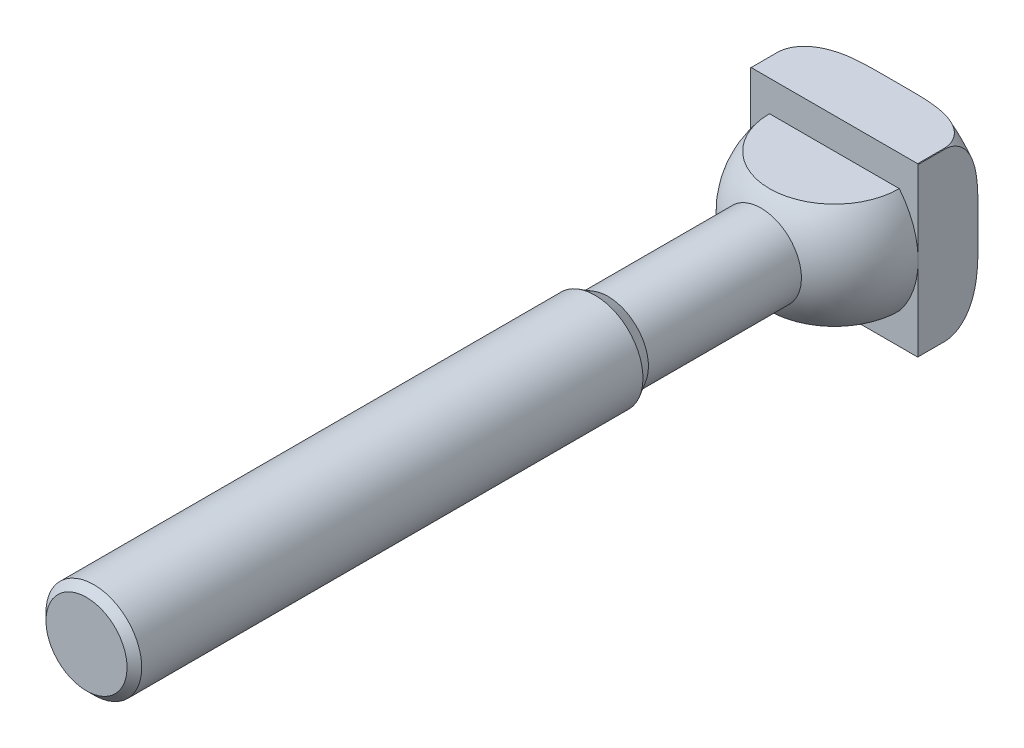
ISO-10303-21;
HEADER;
FILE_DESCRIPTION(('STEP AP214'),'2;1');
FILE_NAME('part.step','',(''),(''),'','','');
FILE_SCHEMA(('AUTOMOTIVE_DESIGN { 1 0 10303 214 1 1 1 1 }'));
ENDSEC;
DATA;
#1=APPLICATION_CONTEXT('core data for automotive mechanical design processes');
#2=APPLICATION_PROTOCOL_DEFINITION('international standard','automotive_design',2000,#1);
#3=PRODUCT_CONTEXT('',#1,'mechanical');
#4=PRODUCT('Part','Part','',(#3));
#5=PRODUCT_RELATED_PRODUCT_CATEGORY('part','',(#4));
#6=PRODUCT_DEFINITION_FORMATION('','',#4);
#7=PRODUCT_DEFINITION_CONTEXT('part definition',#1,'design');
#8=PRODUCT_DEFINITION('design','',#6,#7);
#9=PRODUCT_DEFINITION_SHAPE('','',#8);
#10=(LENGTH_UNIT() NAMED_UNIT(*) SI_UNIT(.MILLI.,.METRE.));
#11=(NAMED_UNIT(*) PLANE_ANGLE_UNIT() SI_UNIT($,.RADIAN.));
#12=(NAMED_UNIT(*) SI_UNIT($,.STERADIAN.) SOLID_ANGLE_UNIT());
#13=UNCERTAINTY_MEASURE_WITH_UNIT(LENGTH_MEASURE(1.E-05),#10,'distance_accuracy_value','');
#14=(GEOMETRIC_REPRESENTATION_CONTEXT(3) GLOBAL_UNCERTAINTY_ASSIGNED_CONTEXT((#13)) GLOBAL_UNIT_ASSIGNED_CONTEXT((#10,
#11,#12)) REPRESENTATION_CONTEXT('',''));
#15=CARTESIAN_POINT('',(0.,0.,0.));
#16=DIRECTION('',(0.,0.,1.));
#17=DIRECTION('',(1.,0.,0.));
#18=AXIS2_PLACEMENT_3D('',#15,#16,#17);
#19=CARTESIAN_POINT('',(0.,0.,-4.4));
#20=DIRECTION('',(0.,0.,1.));
#21=DIRECTION('',(0.,1.,0.));
#22=AXIS2_PLACEMENT_3D('',#19,#20,#21);
#23=TOROIDAL_SURFACE('',#22,14.14,5.6);
#24=CARTESIAN_POINT('',(-14.,0.,-9.99824972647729));
#25=CARTESIAN_POINT('',(-14.,-0.310759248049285,-9.99825085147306));
#26=CARTESIAN_POINT('',(-14.,-0.621518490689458,-9.99853784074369));
#27=CARTESIAN_POINT('',(-14.,-1.24303661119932,-9.99934060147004));
#28=CARTESIAN_POINT('',(-14.,-1.55379548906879,-9.99985637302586));
#29=CARTESIAN_POINT('',(-14.,-2.17555675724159,-10.0000957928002));
#30=CARTESIAN_POINT('',(-14.,-2.48655914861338,-9.99981882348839));
#31=CARTESIAN_POINT('',(-14.,-3.10856376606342,-9.99683999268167));
#32=CARTESIAN_POINT('',(-14.,-3.41956599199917,-9.99413807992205));
#33=CARTESIAN_POINT('',(-14.,-4.04142447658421,-9.98415314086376));
#34=CARTESIAN_POINT('',(-14.,-4.35228075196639,-9.97687135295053));
#35=CARTESIAN_POINT('',(-14.,-4.97375164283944,-9.95513103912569));
#36=CARTESIAN_POINT('',(-14.,-5.28436626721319,-9.94067279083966));
#37=CARTESIAN_POINT('',(-14.,-5.9045731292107,-9.90163480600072));
#38=CARTESIAN_POINT('',(-14.,-6.21416618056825,-9.87706873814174));
#39=CARTESIAN_POINT('',(-14.,-6.83210242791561,-9.8145243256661));
#40=CARTESIAN_POINT('',(-14.,-7.14044538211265,-9.77654350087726));
#41=CARTESIAN_POINT('',(-14.,-7.76037724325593,-9.68271738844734));
#42=CARTESIAN_POINT('',(-14.,-8.07191904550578,-9.62655135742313));
#43=CARTESIAN_POINT('',(-14.,-8.69023154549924,-9.49254678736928));
#44=CARTESIAN_POINT('',(-14.,-8.99700487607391,-9.41472069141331));
#45=CARTESIAN_POINT('',(-14.,-9.60149117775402,-9.23352582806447));
#46=CARTESIAN_POINT('',(-14.,-9.89923995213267,-9.13027881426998));
#47=CARTESIAN_POINT('',(-14.,-10.4824504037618,-8.89388231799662));
#48=CARTESIAN_POINT('',(-14.,-10.7679262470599,-8.76076847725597));
#49=CARTESIAN_POINT('',(-14.,-11.3136573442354,-8.46441782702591));
#50=CARTESIAN_POINT('',(-14.,-11.5743689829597,-8.30203188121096));
#51=CARTESIAN_POINT('',(-14.,-12.0709995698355,-7.94177662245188));
#52=CARTESIAN_POINT('',(-14.,-12.3068984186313,-7.74387888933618));
#53=CARTESIAN_POINT('',(-14.,-12.63518165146,-7.41887852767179));
#54=CARTESIAN_POINT('',(-14.,-12.7408989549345,-7.30509090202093));
#55=CARTESIAN_POINT('',(-14.,-12.9416863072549,-7.06851889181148));
#56=CARTESIAN_POINT('',(-14.,-13.0367621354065,-6.94573945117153));
#57=CARTESIAN_POINT('',(-14.,-13.2145748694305,-6.69177024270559));
#58=CARTESIAN_POINT('',(-14.,-13.2973291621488,-6.56059270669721));
#59=CARTESIAN_POINT('',(-14.,-13.4490161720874,-6.2905462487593));
#60=CARTESIAN_POINT('',(-14.,-13.5179540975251,-6.15168025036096));
#61=CARTESIAN_POINT('',(-14.,-13.6697783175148,-5.79932831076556));
#62=CARTESIAN_POINT('',(-14.,-13.7436357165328,-5.58184122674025));
#63=CARTESIAN_POINT('',(-14.,-13.8537149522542,-5.13762264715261));
#64=CARTESIAN_POINT('',(-14.,-13.8899558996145,-4.91089590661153));
#65=CARTESIAN_POINT('',(-14.,-13.9227119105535,-4.45413617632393));
#66=CARTESIAN_POINT('',(-14.,-13.9191559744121,-4.22409800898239));
#67=CARTESIAN_POINT('',(-14.,-13.8723552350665,-3.76811077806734));
#68=CARTESIAN_POINT('',(-14.,-13.8291052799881,-3.54216224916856));
#69=CARTESIAN_POINT('',(-14.,-13.7070151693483,-3.10597064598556));
#70=CARTESIAN_POINT('',(-14.,-13.6290387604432,-2.89548280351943));
#71=CARTESIAN_POINT('',(-14.,-13.4418093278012,-2.48903531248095));
#72=CARTESIAN_POINT('',(-14.,-13.3325526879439,-2.29307734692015));
#73=CARTESIAN_POINT('',(-14.,-13.0760306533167,-1.90105488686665));
#74=CARTESIAN_POINT('',(-14.,-12.9261604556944,-1.70670634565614));
#75=CARTESIAN_POINT('',(-14.,-12.6009114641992,-1.34062905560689));
#76=CARTESIAN_POINT('',(-14.,-12.425510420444,-1.16892028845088));
#77=CARTESIAN_POINT('',(-14.,-12.0933369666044,-0.881603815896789));
#78=CARTESIAN_POINT('',(-14.,-11.9401944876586,-0.761732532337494));
#79=CARTESIAN_POINT('',(-14.,-11.6238593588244,-0.535952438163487));
#80=CARTESIAN_POINT('',(-14.,-11.4606616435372,-0.430050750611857));
#81=CARTESIAN_POINT('',(-14.,-11.1262197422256,-0.231514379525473));
#82=CARTESIAN_POINT('',(-14.,-10.9549677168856,-0.138892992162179));
#83=CARTESIAN_POINT('',(-14.,-10.6063402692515,0.0338060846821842));
#84=CARTESIAN_POINT('',(-14.,-10.428965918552,0.113885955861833));
#85=CARTESIAN_POINT('',(-14.,-9.95291874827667,0.310667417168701));
#86=CARTESIAN_POINT('',(-14.,-9.65013791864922,0.41746585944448));
#87=CARTESIAN_POINT('',(-14.,-9.03638107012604,0.604202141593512));
#88=CARTESIAN_POINT('',(-14.,-8.72539881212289,0.684118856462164));
#89=CARTESIAN_POINT('',(-14.,-8.09734857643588,0.821773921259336));
#90=CARTESIAN_POINT('',(-14.,-7.78026113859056,0.879421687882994));
#91=CARTESIAN_POINT('',(-14.,-7.14352292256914,0.976351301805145));
#92=CARTESIAN_POINT('',(-14.,-6.82387330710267,1.01564104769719));
#93=CARTESIAN_POINT('',(-14.,-6.08602362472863,1.08964790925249));
#94=CARTESIAN_POINT('',(-14.,-5.66733893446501,1.1193635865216));
#95=CARTESIAN_POINT('',(-14.,-4.82908628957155,1.16245287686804));
#96=CARTESIAN_POINT('',(-14.,-4.40951805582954,1.17582016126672));
#97=CARTESIAN_POINT('',(-14.,-3.56968565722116,1.19303029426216));
#98=CARTESIAN_POINT('',(-14.,-3.14942129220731,1.19686084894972));
#99=CARTESIAN_POINT('',(-14.,-2.30895829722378,1.20041358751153));
#100=CARTESIAN_POINT('',(-14.,-1.88875966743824,1.20013642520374));
#101=CARTESIAN_POINT('',(-14.,-1.04864396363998,1.19915092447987));
#102=CARTESIAN_POINT('',(-14.,-0.628726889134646,1.19844287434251));
#103=CARTESIAN_POINT('',(-14.,0.211127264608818,1.19813401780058));
#104=CARTESIAN_POINT('',(-14.,0.631064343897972,1.19853326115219));
#105=CARTESIAN_POINT('',(-14.,1.47068212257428,1.19965885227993));
#106=CARTESIAN_POINT('',(-14.,1.89036282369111,1.20038500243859));
#107=CARTESIAN_POINT('',(-14.,2.72971643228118,1.19918094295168));
#108=CARTESIAN_POINT('',(-14.,3.14938933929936,1.19725084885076));
#109=CARTESIAN_POINT('',(-14.,3.72184106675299,1.18945550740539));
#110=CARTESIAN_POINT('',(-14.,3.87466005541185,1.18687249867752));
#111=CARTESIAN_POINT('',(-14.,4.18027065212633,1.18040049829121));
#112=CARTESIAN_POINT('',(-14.,4.33306226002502,1.17651149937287));
#113=CARTESIAN_POINT('',(-14.,4.79139482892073,1.16242966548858));
#114=CARTESIAN_POINT('',(-14.,5.09687074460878,1.14982221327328));
#115=CARTESIAN_POINT('',(-14.,5.70773033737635,1.11539646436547));
#116=CARTESIAN_POINT('',(-14.,6.01311337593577,1.0935661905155));
#117=CARTESIAN_POINT('',(-14.,6.62278129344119,1.03760824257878));
#118=CARTESIAN_POINT('',(-14.,6.92706622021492,1.0034811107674));
#119=CARTESIAN_POINT('',(-14.,7.53756680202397,0.919002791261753));
#120=CARTESIAN_POINT('',(-14.,7.84375430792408,0.868441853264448));
#121=CARTESIAN_POINT('',(-14.,8.45235679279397,0.747440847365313));
#122=CARTESIAN_POINT('',(-14.,8.75477072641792,0.676995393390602));
#123=CARTESIAN_POINT('',(-14.,9.35221826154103,0.512485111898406));
#124=CARTESIAN_POINT('',(-14.,9.64727195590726,0.418494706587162));
#125=CARTESIAN_POINT('',(-14.,10.2269376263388,0.20279780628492));
#126=CARTESIAN_POINT('',(-14.,10.5115593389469,0.081117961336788));
#127=CARTESIAN_POINT('',(-14.,11.073245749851,-0.197865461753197));
#128=CARTESIAN_POINT('',(-14.,11.3498592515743,-0.356091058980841));
#129=CARTESIAN_POINT('',(-14.,11.8788610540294,-0.709917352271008));
#130=CARTESIAN_POINT('',(-14.,12.1312420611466,-0.905529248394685));
#131=CARTESIAN_POINT('',(-14.,12.4845698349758,-1.22925474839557));
#132=CARTESIAN_POINT('',(-14.,12.5987850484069,-1.34304039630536));
#133=CARTESIAN_POINT('',(-14.,12.8164661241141,-1.58042428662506));
#134=CARTESIAN_POINT('',(-14.,12.9199380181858,-1.70401695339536));
#135=CARTESIAN_POINT('',(-14.,13.1142800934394,-1.96051354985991));
#136=CARTESIAN_POINT('',(-14.,13.205167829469,-2.09340411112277));
#137=CARTESIAN_POINT('',(-14.,13.372664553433,-2.36782024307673));
#138=CARTESIAN_POINT('',(-14.,13.4492796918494,-2.50934205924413));
#139=CARTESIAN_POINT('',(-14.,13.6163411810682,-2.86319975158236));
#140=CARTESIAN_POINT('',(-14.,13.6983634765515,-3.07961651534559));
#141=CARTESIAN_POINT('',(-14.,13.824923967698,-3.52306568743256));
#142=CARTESIAN_POINT('',(-14.,13.8694841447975,-3.75009178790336));
#143=CARTESIAN_POINT('',(-14.,13.9185610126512,-4.2090333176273));
#144=CARTESIAN_POINT('',(-14.,13.9229835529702,-4.44095896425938));
#145=CARTESIAN_POINT('',(-14.,13.8912351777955,-4.90200336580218));
#146=CARTESIAN_POINT('',(-14.,13.8550611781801,-5.13112190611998));
#147=CARTESIAN_POINT('',(-14.,13.7462858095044,-5.5721594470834));
#148=CARTESIAN_POINT('',(-14.,13.6749635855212,-5.78439832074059));
#149=CARTESIAN_POINT('',(-14.,13.5003447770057,-6.19518406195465));
#150=CARTESIAN_POINT('',(-14.,13.3970432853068,-6.39372882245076));
#151=CARTESIAN_POINT('',(-14.,13.1534590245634,-6.78957755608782));
#152=CARTESIAN_POINT('',(-14.,13.0108272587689,-6.98542587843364));
#153=CARTESIAN_POINT('',(-14.,12.6995996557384,-7.35524295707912));
#154=CARTESIAN_POINT('',(-14.,12.5309874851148,-7.52919782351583));
#155=CARTESIAN_POINT('',(-14.,12.2128466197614,-7.81886907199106));
#156=CARTESIAN_POINT('',(-14.,12.0672621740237,-7.93898454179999));
#157=CARTESIAN_POINT('',(-14.,11.7660321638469,-8.1659118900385));
#158=CARTESIAN_POINT('',(-14.,11.6103820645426,-8.272717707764));
#159=CARTESIAN_POINT('',(-14.,11.1309674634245,-8.57419374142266));
#160=CARTESIAN_POINT('',(-14.,10.7950194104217,-8.74967609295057));
#161=CARTESIAN_POINT('',(-14.,10.1706537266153,-9.02589055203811));
#162=CARTESIAN_POINT('',(-14.,9.88556746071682,-9.13451214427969));
#163=CARTESIAN_POINT('',(-14.,9.30681398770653,-9.32642336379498));
#164=CARTESIAN_POINT('',(-14.,9.01314069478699,-9.40969452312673));
#165=CARTESIAN_POINT('',(-14.,8.42011381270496,-9.55475710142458));
#166=CARTESIAN_POINT('',(-14.,8.12075104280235,-9.61651002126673));
#167=CARTESIAN_POINT('',(-14.,7.51883351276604,-9.72211873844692));
#168=CARTESIAN_POINT('',(-14.,7.21627753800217,-9.7659674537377));
#169=CARTESIAN_POINT('',(-14.,6.62682275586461,-9.83715592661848));
#170=CARTESIAN_POINT('',(-14.,6.34001723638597,-9.86529590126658));
#171=CARTESIAN_POINT('',(-14.,5.76566600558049,-9.91149411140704));
#172=CARTESIAN_POINT('',(-14.,5.47812040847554,-9.92955381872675));
#173=CARTESIAN_POINT('',(-14.,4.90241848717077,-9.95811498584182));
#174=CARTESIAN_POINT('',(-14.,4.61426184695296,-9.96860968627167));
#175=CARTESIAN_POINT('',(-14.,4.03780736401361,-9.98427067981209));
#176=CARTESIAN_POINT('',(-14.,3.74950951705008,-9.98943680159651));
#177=CARTESIAN_POINT('',(-14.,3.17268829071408,-9.99640544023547));
#178=CARTESIAN_POINT('',(-14.,2.88416488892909,-9.99820571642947));
#179=CARTESIAN_POINT('',(-14.,2.30711989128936,-10.0000585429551));
#180=CARTESIAN_POINT('',(-14.,2.01859829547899,-10.0001111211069));
#181=CARTESIAN_POINT('',(-14.,1.44173081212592,-9.99968852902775));
#182=CARTESIAN_POINT('',(-14.,1.15338492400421,-9.99921367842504));
#183=CARTESIAN_POINT('',(-14.,0.576692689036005,-9.99849375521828));
#184=CARTESIAN_POINT('',(-14.,0.2883463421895,-9.99824868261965));
#185=CARTESIAN_POINT('',(-14.,0.,-9.99824972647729));
#186=B_SPLINE_CURVE_WITH_KNOTS('',3,(#24,#25,#26,#27,#28,#29,#30,#31,#32,#33,#34,#35,#36,#37,
#38,#39,#40,#41,#42,#43,#44,#45,#46,#47,#48,#49,#50,#51,#52,#53,#54,#55,#56,#57,#58,#59,#60,#61,
#62,#63,#64,#65,#66,#67,#68,#69,#70,#71,#72,#73,#74,#75,#76,#77,#78,#79,#80,#81,#82,#83,#84,#85,
#86,#87,#88,#89,#90,#91,#92,#93,#94,#95,#96,#97,#98,#99,#100,#101,#102,#103,#104,#105,#106,#107,
#108,#109,#110,#111,#112,#113,#114,#115,#116,#117,#118,#119,#120,#121,#122,#123,#124,#125,#126,
#127,#128,#129,#130,#131,#132,#133,#134,#135,#136,#137,#138,#139,#140,#141,#142,#143,#144,#145,
#146,#147,#148,#149,#150,#151,#152,#153,#154,#155,#156,#157,#158,#159,#160,#161,#162,#163,#164,
#165,#166,#167,#168,#169,#170,#171,#172,#173,#174,#175,#176,#177,#178,#179,#180,#181,#182,#183,
#184,#185),.UNSPECIFIED.,.T.,.F.,(4,2,2,2,2,2,2,2,2,2,2,2,2,2,2,2,2,2,2,2,2,2,2,2,2,2,2,2,2,2,2,
2,2,2,2,2,2,2,2,2,2,2,2,2,2,2,2,2,2,2,2,2,2,2,2,2,2,2,2,2,2,2,2,2,2,2,2,2,2,2,2,2,2,2,2,2,2,2,2,
2,4),(0.,0.932277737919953,1.86455588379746,2.79756045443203,3.73058474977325,4.66335686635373,
5.59609290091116,6.52757173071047,7.45922286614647,8.40829357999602,9.35682020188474,
10.3008893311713,11.2438377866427,12.1628389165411,13.0825788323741,13.5480143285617,
14.0131958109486,14.4777145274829,14.9420578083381,15.6278649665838,16.3133235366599,
17.0000051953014,17.6867759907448,18.3573439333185,19.0279894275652,19.7615747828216,
20.4958033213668,21.0784512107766,21.6613950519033,22.2449185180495,22.8283403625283,
23.7898904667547,24.7521944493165,25.7183725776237,26.6841346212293,27.9428211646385,
29.2019948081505,30.4627908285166,31.7233861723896,32.9831390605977,34.2429485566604,
35.5019975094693,36.7609916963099,37.2195087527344,37.6780283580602,38.5951359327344,
39.5134381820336,40.4316999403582,41.3621750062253,42.2929023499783,43.2207241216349,
44.1476566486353,45.1011871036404,46.0550036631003,46.5381223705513,47.0209683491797,
47.5031338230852,47.985091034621,48.676179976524,49.3668631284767,50.0591659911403,
50.7515214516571,51.4203582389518,52.089297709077,52.8134628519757,53.5380851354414,
54.1035302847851,54.6692319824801,55.8017422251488,56.7158020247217,57.6305261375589,
58.546878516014,59.4635930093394,60.3279216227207,61.1921240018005,62.0570975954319,
62.9220989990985,63.7876760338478,64.6532392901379,65.5182782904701,66.3833173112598),.UNSPECIFIED.);
#187=CARTESIAN_POINT('',(-14.,-1.98484256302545,-10.));
#188=VERTEX_POINT('',#187);
#189=CARTESIAN_POINT('',(-14.,-13.916450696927,-4.4));
#190=VERTEX_POINT('',#189);
#191=EDGE_CURVE('E216',#188,#190,#186,.T.);
#192=ORIENTED_EDGE('',*,*,#191,.F.);
#193=CARTESIAN_POINT('',(0.,0.,-10.));
#194=DIRECTION('',(0.,0.,1.));
#195=DIRECTION('',(0.,1.,0.));
#196=AXIS2_PLACEMENT_3D('',#193,#194,#195);
#197=CIRCLE('',#196,14.14);
#198=CARTESIAN_POINT('',(-1.98484256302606,-14.,-10.));
#199=VERTEX_POINT('',#198);
#200=EDGE_CURVE('E291',#188,#199,#197,.T.);
#201=ORIENTED_EDGE('',*,*,#200,.T.);
#202=CARTESIAN_POINT('',(0.,-14.,-9.99824972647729));
#203=CARTESIAN_POINT('',(0.310759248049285,-14.,-9.99825085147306));
#204=CARTESIAN_POINT('',(0.621518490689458,-14.,-9.99853784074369));
#205=CARTESIAN_POINT('',(1.24303661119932,-14.,-9.99934060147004));
#206=CARTESIAN_POINT('',(1.55379548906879,-14.,-9.99985637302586));
#207=CARTESIAN_POINT('',(2.17555675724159,-14.,-10.0000957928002));
#208=CARTESIAN_POINT('',(2.48655914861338,-14.,-9.99981882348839));
#209=CARTESIAN_POINT('',(3.10856376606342,-14.,-9.99683999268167));
#210=CARTESIAN_POINT('',(3.41956599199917,-14.,-9.99413807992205));
#211=CARTESIAN_POINT('',(4.04142447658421,-14.,-9.98415314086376));
#212=CARTESIAN_POINT('',(4.35228075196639,-14.,-9.97687135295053));
#213=CARTESIAN_POINT('',(4.97375164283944,-14.,-9.95513103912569));
#214=CARTESIAN_POINT('',(5.28436626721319,-14.,-9.94067279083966));
#215=CARTESIAN_POINT('',(5.9045731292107,-14.,-9.90163480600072));
#216=CARTESIAN_POINT('',(6.21416618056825,-14.,-9.87706873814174));
#217=CARTESIAN_POINT('',(6.83210242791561,-14.,-9.8145243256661));
#218=CARTESIAN_POINT('',(7.14044538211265,-14.,-9.77654350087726));
#219=CARTESIAN_POINT('',(7.76037724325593,-14.,-9.68271738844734));
#220=CARTESIAN_POINT('',(8.07191904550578,-14.,-9.62655135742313));
#221=CARTESIAN_POINT('',(8.69023154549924,-14.,-9.49254678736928));
#222=CARTESIAN_POINT('',(8.99700487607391,-14.,-9.41472069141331));
#223=CARTESIAN_POINT('',(9.60149117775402,-14.,-9.23352582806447));
#224=CARTESIAN_POINT('',(9.89923995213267,-14.,-9.13027881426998));
#225=CARTESIAN_POINT('',(10.4824504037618,-14.,-8.89388231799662));
#226=CARTESIAN_POINT('',(10.7679262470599,-14.,-8.76076847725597));
#227=CARTESIAN_POINT('',(11.3136573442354,-14.,-8.46441782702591));
#228=CARTESIAN_POINT('',(11.5743689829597,-14.,-8.30203188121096));
#229=CARTESIAN_POINT('',(12.0709995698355,-14.,-7.94177662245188));
#230=CARTESIAN_POINT('',(12.3068984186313,-14.,-7.74387888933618));
#231=CARTESIAN_POINT('',(12.63518165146,-14.,-7.41887852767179));
#232=CARTESIAN_POINT('',(12.7408989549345,-14.,-7.30509090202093));
#233=CARTESIAN_POINT('',(12.9416863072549,-14.,-7.06851889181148));
#234=CARTESIAN_POINT('',(13.0367621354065,-14.,-6.94573945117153));
#235=CARTESIAN_POINT('',(13.2145748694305,-14.,-6.69177024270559));
#236=CARTESIAN_POINT('',(13.2973291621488,-14.,-6.56059270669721));
#237=CARTESIAN_POINT('',(13.4490161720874,-14.,-6.2905462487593));
#238=CARTESIAN_POINT('',(13.5179540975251,-14.,-6.15168025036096));
#239=CARTESIAN_POINT('',(13.6697783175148,-14.,-5.79932831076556));
#240=CARTESIAN_POINT('',(13.7436357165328,-14.,-5.58184122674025));
#241=CARTESIAN_POINT('',(13.8537149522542,-14.,-5.13762264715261));
#242=CARTESIAN_POINT('',(13.8899558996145,-14.,-4.91089590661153));
#243=CARTESIAN_POINT('',(13.9227119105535,-14.,-4.45413617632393));
#244=CARTESIAN_POINT('',(13.9191559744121,-14.,-4.22409800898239));
#245=CARTESIAN_POINT('',(13.8723552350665,-14.,-3.76811077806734));
#246=CARTESIAN_POINT('',(13.8291052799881,-14.,-3.54216224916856));
#247=CARTESIAN_POINT('',(13.7070151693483,-14.,-3.10597064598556));
#248=CARTESIAN_POINT('',(13.6290387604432,-14.,-2.89548280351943));
#249=CARTESIAN_POINT('',(13.4418093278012,-14.,-2.48903531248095));
#250=CARTESIAN_POINT('',(13.3325526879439,-14.,-2.29307734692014));
#251=CARTESIAN_POINT('',(13.0760306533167,-14.,-1.90105488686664));
#252=CARTESIAN_POINT('',(12.9261604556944,-14.,-1.70670634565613));
#253=CARTESIAN_POINT('',(12.6009114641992,-14.,-1.34062905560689));
#254=CARTESIAN_POINT('',(12.425510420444,-14.,-1.16892028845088));
#255=CARTESIAN_POINT('',(12.0933369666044,-14.,-0.881603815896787));
#256=CARTESIAN_POINT('',(11.9401944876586,-14.,-0.761732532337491));
#257=CARTESIAN_POINT('',(11.6238593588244,-14.,-0.535952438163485));
#258=CARTESIAN_POINT('',(11.4606616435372,-14.,-0.430050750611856));
#259=CARTESIAN_POINT('',(11.1262197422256,-14.,-0.231514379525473));
#260=CARTESIAN_POINT('',(10.9549677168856,-14.,-0.138892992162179));
#261=CARTESIAN_POINT('',(10.6063402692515,-14.,0.0338060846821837));
#262=CARTESIAN_POINT('',(10.428965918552,-14.,0.113885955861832));
#263=CARTESIAN_POINT('',(9.95291874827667,-14.,0.310667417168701));
#264=CARTESIAN_POINT('',(9.65013791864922,-14.,0.417465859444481));
#265=CARTESIAN_POINT('',(9.03638107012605,-14.,0.604202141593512));
#266=CARTESIAN_POINT('',(8.72539881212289,-14.,0.684118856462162));
#267=CARTESIAN_POINT('',(8.09734857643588,-14.,0.821773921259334));
#268=CARTESIAN_POINT('',(7.78026113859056,-14.,0.879421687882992));
#269=CARTESIAN_POINT('',(7.14352292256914,-14.,0.976351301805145));
#270=CARTESIAN_POINT('',(6.82387330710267,-14.,1.01564104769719));
#271=CARTESIAN_POINT('',(6.08602362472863,-14.,1.08964790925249));
#272=CARTESIAN_POINT('',(5.66733893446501,-14.,1.1193635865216));
#273=CARTESIAN_POINT('',(4.82908628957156,-14.,1.16245287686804));
#274=CARTESIAN_POINT('',(4.40951805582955,-14.,1.17582016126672));
#275=CARTESIAN_POINT('',(3.56968565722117,-14.,1.19303029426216));
#276=CARTESIAN_POINT('',(3.14942129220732,-14.,1.19686084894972));
#277=CARTESIAN_POINT('',(2.30895829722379,-14.,1.20041358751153));
#278=CARTESIAN_POINT('',(1.88875966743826,-14.,1.20013642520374));
#279=CARTESIAN_POINT('',(1.04864396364,-14.,1.19915092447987));
#280=CARTESIAN_POINT('',(0.628726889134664,-14.,1.19844287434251));
#281=CARTESIAN_POINT('',(-0.211127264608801,-14.,1.19813401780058));
#282=CARTESIAN_POINT('',(-0.631064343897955,-14.,1.19853326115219));
#283=CARTESIAN_POINT('',(-1.47068212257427,-14.,1.19965885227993));
#284=CARTESIAN_POINT('',(-1.89036282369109,-14.,1.20038500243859));
#285=CARTESIAN_POINT('',(-2.72971643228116,-14.,1.19918094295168));
#286=CARTESIAN_POINT('',(-3.14938933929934,-14.,1.19725084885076));
#287=CARTESIAN_POINT('',(-3.72184106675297,-14.,1.18945550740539));
#288=CARTESIAN_POINT('',(-3.87466005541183,-14.,1.18687249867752));
#289=CARTESIAN_POINT('',(-4.18027065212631,-14.,1.18040049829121));
#290=CARTESIAN_POINT('',(-4.333062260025,-14.,1.17651149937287));
#291=CARTESIAN_POINT('',(-4.79139482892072,-14.,1.16242966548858));
#292=CARTESIAN_POINT('',(-5.09687074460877,-14.,1.14982221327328));
#293=CARTESIAN_POINT('',(-5.70773033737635,-14.,1.11539646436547));
#294=CARTESIAN_POINT('',(-6.01311337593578,-14.,1.0935661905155));
#295=CARTESIAN_POINT('',(-6.62278129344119,-14.,1.03760824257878));
#296=CARTESIAN_POINT('',(-6.92706622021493,-14.,1.0034811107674));
#297=CARTESIAN_POINT('',(-7.53756680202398,-14.,0.919002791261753));
#298=CARTESIAN_POINT('',(-7.8437543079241,-14.,0.868441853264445));
#299=CARTESIAN_POINT('',(-8.45235679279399,-14.,0.747440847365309));
#300=CARTESIAN_POINT('',(-8.75477072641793,-14.,0.676995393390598));
#301=CARTESIAN_POINT('',(-9.35221826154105,-14.,0.512485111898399));
#302=CARTESIAN_POINT('',(-9.64727195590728,-14.,0.418494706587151));
#303=CARTESIAN_POINT('',(-10.2269376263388,-14.,0.202797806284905));
#304=CARTESIAN_POINT('',(-10.5115593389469,-14.,0.0811179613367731));
#305=CARTESIAN_POINT('',(-11.0732457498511,-14.,-0.197865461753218));
#306=CARTESIAN_POINT('',(-11.3498592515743,-14.,-0.356091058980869));
#307=CARTESIAN_POINT('',(-11.8788610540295,-14.,-0.709917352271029));
#308=CARTESIAN_POINT('',(-12.1312420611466,-14.,-0.905529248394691));
#309=CARTESIAN_POINT('',(-12.4845698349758,-14.,-1.22925474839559));
#310=CARTESIAN_POINT('',(-12.5987850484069,-14.,-1.34304039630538));
#311=CARTESIAN_POINT('',(-12.8164661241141,-14.,-1.58042428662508));
#312=CARTESIAN_POINT('',(-12.9199380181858,-14.,-1.70401695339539));
#313=CARTESIAN_POINT('',(-13.1142800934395,-14.,-1.96051354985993));
#314=CARTESIAN_POINT('',(-13.205167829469,-14.,-2.09340411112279));
#315=CARTESIAN_POINT('',(-13.372664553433,-14.,-2.36782024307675));
#316=CARTESIAN_POINT('',(-13.4492796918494,-14.,-2.50934205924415));
#317=CARTESIAN_POINT('',(-13.6163411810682,-14.,-2.86319975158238));
#318=CARTESIAN_POINT('',(-13.6983634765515,-14.,-3.07961651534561));
#319=CARTESIAN_POINT('',(-13.824923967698,-14.,-3.52306568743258));
#320=CARTESIAN_POINT('',(-13.8694841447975,-14.,-3.75009178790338));
#321=CARTESIAN_POINT('',(-13.9185610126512,-14.,-4.20903331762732));
#322=CARTESIAN_POINT('',(-13.9229835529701,-14.,-4.4409589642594));
#323=CARTESIAN_POINT('',(-13.8912351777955,-14.,-4.9020033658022));
#324=CARTESIAN_POINT('',(-13.8550611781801,-14.,-5.13112190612));
#325=CARTESIAN_POINT('',(-13.7462858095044,-14.,-5.57215944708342));
#326=CARTESIAN_POINT('',(-13.6749635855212,-14.,-5.7843983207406));
#327=CARTESIAN_POINT('',(-13.5003447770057,-14.,-6.19518406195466));
#328=CARTESIAN_POINT('',(-13.3970432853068,-14.,-6.39372882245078));
#329=CARTESIAN_POINT('',(-13.1534590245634,-14.,-6.78957755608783));
#330=CARTESIAN_POINT('',(-13.0108272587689,-14.,-6.98542587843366));
#331=CARTESIAN_POINT('',(-12.6995996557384,-14.,-7.35524295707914));
#332=CARTESIAN_POINT('',(-12.5309874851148,-14.,-7.52919782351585));
#333=CARTESIAN_POINT('',(-12.2128466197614,-14.,-7.81886907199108));
#334=CARTESIAN_POINT('',(-12.0672621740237,-14.,-7.93898454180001));
#335=CARTESIAN_POINT('',(-11.7660321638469,-14.,-8.16591189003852));
#336=CARTESIAN_POINT('',(-11.6103820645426,-14.,-8.27271770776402));
#337=CARTESIAN_POINT('',(-11.1309674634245,-14.,-8.57419374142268));
#338=CARTESIAN_POINT('',(-10.7950194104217,-14.,-8.74967609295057));
#339=CARTESIAN_POINT('',(-10.1706537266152,-14.,-9.02589055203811));
#340=CARTESIAN_POINT('',(-9.88556746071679,-14.,-9.1345121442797));
#341=CARTESIAN_POINT('',(-9.3068139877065,-14.,-9.32642336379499));
#342=CARTESIAN_POINT('',(-9.01314069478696,-14.,-9.40969452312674));
#343=CARTESIAN_POINT('',(-8.42011381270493,-14.,-9.55475710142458));
#344=CARTESIAN_POINT('',(-8.12075104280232,-14.,-9.61651002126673));
#345=CARTESIAN_POINT('',(-7.518833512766,-14.,-9.72211873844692));
#346=CARTESIAN_POINT('',(-7.21627753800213,-14.,-9.76596745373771));
#347=CARTESIAN_POINT('',(-6.62682275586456,-14.,-9.83715592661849));
#348=CARTESIAN_POINT('',(-6.34001723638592,-14.,-9.86529590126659));
#349=CARTESIAN_POINT('',(-5.76566600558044,-14.,-9.91149411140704));
#350=CARTESIAN_POINT('',(-5.4781204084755,-14.,-9.92955381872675));
#351=CARTESIAN_POINT('',(-4.90241848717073,-14.,-9.95811498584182));
#352=CARTESIAN_POINT('',(-4.61426184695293,-14.,-9.96860968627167));
#353=CARTESIAN_POINT('',(-4.03780736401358,-14.,-9.98427067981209));
#354=CARTESIAN_POINT('',(-3.74950951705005,-14.,-9.98943680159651));
#355=CARTESIAN_POINT('',(-3.17268829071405,-14.,-9.99640544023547));
#356=CARTESIAN_POINT('',(-2.88416488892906,-14.,-9.99820571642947));
#357=CARTESIAN_POINT('',(-2.30711989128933,-14.,-10.0000585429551));
#358=CARTESIAN_POINT('',(-2.01859829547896,-14.,-10.0001111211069));
#359=CARTESIAN_POINT('',(-1.44173081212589,-14.,-9.99968852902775));
#360=CARTESIAN_POINT('',(-1.15338492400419,-14.,-9.99921367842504));
#361=CARTESIAN_POINT('',(-0.576692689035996,-14.,-9.99849375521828));
#362=CARTESIAN_POINT('',(-0.288346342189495,-14.,-9.99824868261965));
#363=CARTESIAN_POINT('',(0.,-14.,-9.99824972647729));
#364=B_SPLINE_CURVE_WITH_KNOTS('',3,(#202,#203,#204,#205,#206,#207,#208,#209,#210,#211,#212,
#213,#214,#215,#216,#217,#218,#219,#220,#221,#222,#223,#224,#225,#226,#227,#228,#229,#230,#231,
#232,#233,#234,#235,#236,#237,#238,#239,#240,#241,#242,#243,#244,#245,#246,#247,#248,#249,#250,
#251,#252,#253,#254,#255,#256,#257,#258,#259,#260,#261,#262,#263,#264,#265,#266,#267,#268,#269,
#270,#271,#272,#273,#274,#275,#276,#277,#278,#279,#280,#281,#282,#283,#284,#285,#286,#287,#288,
#289,#290,#291,#292,#293,#294,#295,#296,#297,#298,#299,#300,#301,#302,#303,#304,#305,#306,#307,
#308,#309,#310,#311,#312,#313,#314,#315,#316,#317,#318,#319,#320,#321,#322,#323,#324,#325,#326,
#327,#328,#329,#330,#331,#332,#333,#334,#335,#336,#337,#338,#339,#340,#341,#342,#343,#344,#345,
#346,#347,#348,#349,#350,#351,#352,#353,#354,#355,#356,#357,#358,#359,#360,#361,#362,#363),
.UNSPECIFIED.,.T.,.F.,(4,2,2,2,2,2,2,2,2,2,2,2,2,2,2,2,2,2,2,2,2,2,2,2,2,2,2,2,2,2,2,2,2,2,2,2,
2,2,2,2,2,2,2,2,2,2,2,2,2,2,2,2,2,2,2,2,2,2,2,2,2,2,2,2,2,2,2,2,2,2,2,2,2,2,2,2,2,2,2,2,4),(0.,
0.932277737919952,1.86455588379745,2.79756045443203,3.73058474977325,4.66335686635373,
5.59609290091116,6.52757173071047,7.45922286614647,8.40829357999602,9.35682020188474,
10.3008893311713,11.2438377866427,12.1628389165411,13.0825788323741,13.5480143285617,
14.0131958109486,14.4777145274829,14.9420578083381,15.6278649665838,16.3133235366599,
17.0000051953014,17.6867759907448,18.3573439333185,19.0279894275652,19.7615747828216,
20.4958033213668,21.0784512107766,21.6613950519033,22.2449185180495,22.8283403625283,
23.7898904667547,24.7521944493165,25.7183725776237,26.6841346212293,27.9428211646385,
29.2019948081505,30.4627908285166,31.7233861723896,32.9831390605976,34.2429485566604,
35.5019975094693,36.7609916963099,37.2195087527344,37.6780283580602,38.5951359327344,
39.5134381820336,40.4316999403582,41.3621750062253,42.2929023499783,43.220724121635,
44.1476566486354,45.1011871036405,46.0550036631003,46.5381223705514,47.0209683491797,
47.5031338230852,47.9850910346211,48.676179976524,49.3668631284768,50.0591659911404,
50.7515214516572,51.4203582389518,52.089297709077,52.8134628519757,53.5380851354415,
54.1035302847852,54.6692319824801,55.8017422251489,56.7158020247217,57.6305261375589,
58.5468785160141,59.4635930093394,60.3279216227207,61.1921240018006,62.0570975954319,
62.9220989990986,63.7876760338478,64.6532392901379,65.5182782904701,66.3833173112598),.UNSPECIFIED.);
#365=CARTESIAN_POINT('',(-13.916450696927,-14.,-4.4));
#366=VERTEX_POINT('',#365);
#367=EDGE_CURVE('E177',#366,#199,#364,.T.);
#368=ORIENTED_EDGE('',*,*,#367,.F.);
#369=CARTESIAN_POINT('',(0.,0.,-4.4));
#370=DIRECTION('',(0.,0.,1.));
#371=DIRECTION('',(0.,1.,0.));
#372=AXIS2_PLACEMENT_3D('',#369,#370,#371);
#373=CIRCLE('',#372,19.74);
#374=EDGE_CURVE('E174',#190,#366,#373,.T.);
#375=ORIENTED_EDGE('',*,*,#374,.F.);
#376=EDGE_LOOP('',(#192,#201,#368,#375));
#377=FACE_BOUND('',#376,.T.);
#378=ADVANCED_FACE('F14',(#377),#23,.T.);
#379=CARTESIAN_POINT('',(1.98484256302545,-14.,-10.));
#380=VERTEX_POINT('',#379);
#381=CARTESIAN_POINT('',(13.916450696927,-14.,-4.4));
#382=VERTEX_POINT('',#381);
#383=EDGE_CURVE('E180',#380,#382,#364,.T.);
#384=ORIENTED_EDGE('',*,*,#383,.F.);
#385=CARTESIAN_POINT('',(14.,-1.98484256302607,-10.));
#386=VERTEX_POINT('',#385);
#387=EDGE_CURVE('E288',#380,#386,#197,.T.);
#388=ORIENTED_EDGE('',*,*,#387,.T.);
#389=CARTESIAN_POINT('',(14.,0.,-9.99824972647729));
#390=CARTESIAN_POINT('',(14.,0.310759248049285,-9.99825085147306));
#391=CARTESIAN_POINT('',(14.,0.621518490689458,-9.99853784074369));
#392=CARTESIAN_POINT('',(14.,1.24303661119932,-9.99934060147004));
#393=CARTESIAN_POINT('',(14.,1.55379548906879,-9.99985637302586));
#394=CARTESIAN_POINT('',(14.,2.17555675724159,-10.0000957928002));
#395=CARTESIAN_POINT('',(14.,2.48655914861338,-9.99981882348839));
#396=CARTESIAN_POINT('',(14.,3.10856376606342,-9.99683999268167));
#397=CARTESIAN_POINT('',(14.,3.41956599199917,-9.99413807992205));
#398=CARTESIAN_POINT('',(14.,4.04142447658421,-9.98415314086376));
#399=CARTESIAN_POINT('',(14.,4.35228075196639,-9.97687135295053));
#400=CARTESIAN_POINT('',(14.,4.97375164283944,-9.95513103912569));
#401=CARTESIAN_POINT('',(14.,5.28436626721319,-9.94067279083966));
#402=CARTESIAN_POINT('',(14.,5.9045731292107,-9.90163480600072));
#403=CARTESIAN_POINT('',(14.,6.21416618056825,-9.87706873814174));
#404=CARTESIAN_POINT('',(14.,6.83210242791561,-9.8145243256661));
#405=CARTESIAN_POINT('',(14.,7.14044538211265,-9.77654350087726));
#406=CARTESIAN_POINT('',(14.,7.76037724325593,-9.68271738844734));
#407=CARTESIAN_POINT('',(14.,8.07191904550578,-9.62655135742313));
#408=CARTESIAN_POINT('',(14.,8.69023154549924,-9.49254678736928));
#409=CARTESIAN_POINT('',(14.,8.99700487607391,-9.41472069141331));
#410=CARTESIAN_POINT('',(14.,9.60149117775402,-9.23352582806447));
#411=CARTESIAN_POINT('',(14.,9.89923995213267,-9.13027881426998));
#412=CARTESIAN_POINT('',(14.,10.4824504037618,-8.89388231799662));
#413=CARTESIAN_POINT('',(14.,10.7679262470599,-8.76076847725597));
#414=CARTESIAN_POINT('',(14.,11.3136573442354,-8.46441782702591));
#415=CARTESIAN_POINT('',(14.,11.5743689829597,-8.30203188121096));
#416=CARTESIAN_POINT('',(14.,12.0709995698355,-7.94177662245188));
#417=CARTESIAN_POINT('',(14.,12.3068984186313,-7.74387888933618));
#418=CARTESIAN_POINT('',(14.,12.63518165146,-7.41887852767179));
#419=CARTESIAN_POINT('',(14.,12.7408989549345,-7.30509090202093));
#420=CARTESIAN_POINT('',(14.,12.9416863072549,-7.06851889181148));
#421=CARTESIAN_POINT('',(14.,13.0367621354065,-6.94573945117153));
#422=CARTESIAN_POINT('',(14.,13.2145748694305,-6.69177024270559));
#423=CARTESIAN_POINT('',(14.,13.2973291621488,-6.56059270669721));
#424=CARTESIAN_POINT('',(14.,13.4490161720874,-6.2905462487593));
#425=CARTESIAN_POINT('',(14.,13.5179540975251,-6.15168025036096));
#426=CARTESIAN_POINT('',(14.,13.6697783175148,-5.79932831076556));
#427=CARTESIAN_POINT('',(14.,13.7436357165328,-5.58184122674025));
#428=CARTESIAN_POINT('',(14.,13.8537149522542,-5.13762264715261));
#429=CARTESIAN_POINT('',(14.,13.8899558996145,-4.91089590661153));
#430=CARTESIAN_POINT('',(14.,13.9227119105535,-4.45413617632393));
#431=CARTESIAN_POINT('',(14.,13.9191559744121,-4.22409800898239));
#432=CARTESIAN_POINT('',(14.,13.8723552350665,-3.76811077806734));
#433=CARTESIAN_POINT('',(14.,13.8291052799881,-3.54216224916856));
#434=CARTESIAN_POINT('',(14.,13.7070151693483,-3.10597064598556));
#435=CARTESIAN_POINT('',(14.,13.6290387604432,-2.89548280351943));
#436=CARTESIAN_POINT('',(14.,13.4418093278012,-2.48903531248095));
#437=CARTESIAN_POINT('',(14.,13.3325526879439,-2.29307734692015));
#438=CARTESIAN_POINT('',(14.,13.0760306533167,-1.90105488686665));
#439=CARTESIAN_POINT('',(14.,12.9261604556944,-1.70670634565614));
#440=CARTESIAN_POINT('',(14.,12.6009114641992,-1.34062905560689));
#441=CARTESIAN_POINT('',(14.,12.425510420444,-1.16892028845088));
#442=CARTESIAN_POINT('',(14.,12.0933369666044,-0.881603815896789));
#443=CARTESIAN_POINT('',(14.,11.9401944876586,-0.761732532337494));
#444=CARTESIAN_POINT('',(14.,11.6238593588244,-0.535952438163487));
#445=CARTESIAN_POINT('',(14.,11.4606616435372,-0.430050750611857));
#446=CARTESIAN_POINT('',(14.,11.1262197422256,-0.231514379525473));
#447=CARTESIAN_POINT('',(14.,10.9549677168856,-0.138892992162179));
#448=CARTESIAN_POINT('',(14.,10.6063402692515,0.0338060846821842));
#449=CARTESIAN_POINT('',(14.,10.428965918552,0.113885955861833));
#450=CARTESIAN_POINT('',(14.,9.95291874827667,0.310667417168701));
#451=CARTESIAN_POINT('',(14.,9.65013791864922,0.41746585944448));
#452=CARTESIAN_POINT('',(14.,9.03638107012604,0.604202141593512));
#453=CARTESIAN_POINT('',(14.,8.72539881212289,0.684118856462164));
#454=CARTESIAN_POINT('',(14.,8.09734857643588,0.821773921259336));
#455=CARTESIAN_POINT('',(14.,7.78026113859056,0.879421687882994));
#456=CARTESIAN_POINT('',(14.,7.14352292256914,0.976351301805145));
#457=CARTESIAN_POINT('',(14.,6.82387330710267,1.01564104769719));
#458=CARTESIAN_POINT('',(14.,6.08602362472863,1.08964790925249));
#459=CARTESIAN_POINT('',(14.,5.66733893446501,1.1193635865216));
#460=CARTESIAN_POINT('',(14.,4.82908628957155,1.16245287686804));
#461=CARTESIAN_POINT('',(14.,4.40951805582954,1.17582016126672));
#462=CARTESIAN_POINT('',(14.,3.56968565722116,1.19303029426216));
#463=CARTESIAN_POINT('',(14.,3.14942129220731,1.19686084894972));
#464=CARTESIAN_POINT('',(14.,2.30895829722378,1.20041358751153));
#465=CARTESIAN_POINT('',(14.,1.88875966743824,1.20013642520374));
#466=CARTESIAN_POINT('',(14.,1.04864396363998,1.19915092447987));
#467=CARTESIAN_POINT('',(14.,0.628726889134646,1.19844287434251));
#468=CARTESIAN_POINT('',(14.,-0.211127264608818,1.19813401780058));
#469=CARTESIAN_POINT('',(14.,-0.631064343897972,1.19853326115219));
#470=CARTESIAN_POINT('',(14.,-1.47068212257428,1.19965885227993));
#471=CARTESIAN_POINT('',(14.,-1.89036282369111,1.20038500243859));
#472=CARTESIAN_POINT('',(14.,-2.72971643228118,1.19918094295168));
#473=CARTESIAN_POINT('',(14.,-3.14938933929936,1.19725084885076));
#474=CARTESIAN_POINT('',(14.,-3.72184106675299,1.18945550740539));
#475=CARTESIAN_POINT('',(14.,-3.87466005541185,1.18687249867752));
#476=CARTESIAN_POINT('',(14.,-4.18027065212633,1.18040049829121));
#477=CARTESIAN_POINT('',(14.,-4.33306226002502,1.17651149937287));
#478=CARTESIAN_POINT('',(14.,-4.79139482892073,1.16242966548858));
#479=CARTESIAN_POINT('',(14.,-5.09687074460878,1.14982221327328));
#480=CARTESIAN_POINT('',(14.,-5.70773033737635,1.11539646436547));
#481=CARTESIAN_POINT('',(14.,-6.01311337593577,1.0935661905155));
#482=CARTESIAN_POINT('',(14.,-6.62278129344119,1.03760824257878));
#483=CARTESIAN_POINT('',(14.,-6.92706622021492,1.0034811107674));
#484=CARTESIAN_POINT('',(14.,-7.53756680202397,0.919002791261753));
#485=CARTESIAN_POINT('',(14.,-7.84375430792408,0.868441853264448));
#486=CARTESIAN_POINT('',(14.,-8.45235679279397,0.747440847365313));
#487=CARTESIAN_POINT('',(14.,-8.75477072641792,0.676995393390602));
#488=CARTESIAN_POINT('',(14.,-9.35221826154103,0.512485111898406));
#489=CARTESIAN_POINT('',(14.,-9.64727195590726,0.418494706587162));
#490=CARTESIAN_POINT('',(14.,-10.2269376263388,0.20279780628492));
#491=CARTESIAN_POINT('',(14.,-10.5115593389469,0.081117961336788));
#492=CARTESIAN_POINT('',(14.,-11.073245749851,-0.197865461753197));
#493=CARTESIAN_POINT('',(14.,-11.3498592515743,-0.356091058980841));
#494=CARTESIAN_POINT('',(14.,-11.8788610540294,-0.709917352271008));
#495=CARTESIAN_POINT('',(14.,-12.1312420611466,-0.905529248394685));
#496=CARTESIAN_POINT('',(14.,-12.4845698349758,-1.22925474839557));
#497=CARTESIAN_POINT('',(14.,-12.5987850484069,-1.34304039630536));
#498=CARTESIAN_POINT('',(14.,-12.8164661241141,-1.58042428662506));
#499=CARTESIAN_POINT('',(14.,-12.9199380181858,-1.70401695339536));
#500=CARTESIAN_POINT('',(14.,-13.1142800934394,-1.96051354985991));
#501=CARTESIAN_POINT('',(14.,-13.205167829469,-2.09340411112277));
#502=CARTESIAN_POINT('',(14.,-13.372664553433,-2.36782024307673));
#503=CARTESIAN_POINT('',(14.,-13.4492796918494,-2.50934205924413));
#504=CARTESIAN_POINT('',(14.,-13.6163411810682,-2.86319975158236));
#505=CARTESIAN_POINT('',(14.,-13.6983634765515,-3.07961651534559));
#506=CARTESIAN_POINT('',(14.,-13.824923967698,-3.52306568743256));
#507=CARTESIAN_POINT('',(14.,-13.8694841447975,-3.75009178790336));
#508=CARTESIAN_POINT('',(14.,-13.9185610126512,-4.2090333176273));
#509=CARTESIAN_POINT('',(14.,-13.9229835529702,-4.44095896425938));
#510=CARTESIAN_POINT('',(14.,-13.8912351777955,-4.90200336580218));
#511=CARTESIAN_POINT('',(14.,-13.8550611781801,-5.13112190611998));
#512=CARTESIAN_POINT('',(14.,-13.7462858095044,-5.5721594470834));
#513=CARTESIAN_POINT('',(14.,-13.6749635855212,-5.78439832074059));
#514=CARTESIAN_POINT('',(14.,-13.5003447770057,-6.19518406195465));
#515=CARTESIAN_POINT('',(14.,-13.3970432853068,-6.39372882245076));
#516=CARTESIAN_POINT('',(14.,-13.1534590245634,-6.78957755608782));
#517=CARTESIAN_POINT('',(14.,-13.0108272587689,-6.98542587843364));
#518=CARTESIAN_POINT('',(14.,-12.6995996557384,-7.35524295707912));
#519=CARTESIAN_POINT('',(14.,-12.5309874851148,-7.52919782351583));
#520=CARTESIAN_POINT('',(14.,-12.2128466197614,-7.81886907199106));
#521=CARTESIAN_POINT('',(14.,-12.0672621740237,-7.93898454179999));
#522=CARTESIAN_POINT('',(14.,-11.7660321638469,-8.1659118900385));
#523=CARTESIAN_POINT('',(14.,-11.6103820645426,-8.272717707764));
#524=CARTESIAN_POINT('',(14.,-11.1309674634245,-8.57419374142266));
#525=CARTESIAN_POINT('',(14.,-10.7950194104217,-8.74967609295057));
#526=CARTESIAN_POINT('',(14.,-10.1706537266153,-9.02589055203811));
#527=CARTESIAN_POINT('',(14.,-9.88556746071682,-9.13451214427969));
#528=CARTESIAN_POINT('',(14.,-9.30681398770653,-9.32642336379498));
#529=CARTESIAN_POINT('',(14.,-9.01314069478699,-9.40969452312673));
#530=CARTESIAN_POINT('',(14.,-8.42011381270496,-9.55475710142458));
#531=CARTESIAN_POINT('',(14.,-8.12075104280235,-9.61651002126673));
#532=CARTESIAN_POINT('',(14.,-7.51883351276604,-9.72211873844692));
#533=CARTESIAN_POINT('',(14.,-7.21627753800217,-9.7659674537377));
#534=CARTESIAN_POINT('',(14.,-6.62682275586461,-9.83715592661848));
#535=CARTESIAN_POINT('',(14.,-6.34001723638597,-9.86529590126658));
#536=CARTESIAN_POINT('',(14.,-5.76566600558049,-9.91149411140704));
#537=CARTESIAN_POINT('',(14.,-5.47812040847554,-9.92955381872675));
#538=CARTESIAN_POINT('',(14.,-4.90241848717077,-9.95811498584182));
#539=CARTESIAN_POINT('',(14.,-4.61426184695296,-9.96860968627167));
#540=CARTESIAN_POINT('',(14.,-4.03780736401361,-9.98427067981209));
#541=CARTESIAN_POINT('',(14.,-3.74950951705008,-9.98943680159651));
#542=CARTESIAN_POINT('',(14.,-3.17268829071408,-9.99640544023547));
#543=CARTESIAN_POINT('',(14.,-2.88416488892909,-9.99820571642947));
#544=CARTESIAN_POINT('',(14.,-2.30711989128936,-10.0000585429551));
#545=CARTESIAN_POINT('',(14.,-2.01859829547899,-10.0001111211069));
#546=CARTESIAN_POINT('',(14.,-1.44173081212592,-9.99968852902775));
#547=CARTESIAN_POINT('',(14.,-1.15338492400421,-9.99921367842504));
#548=CARTESIAN_POINT('',(14.,-0.576692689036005,-9.99849375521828));
#549=CARTESIAN_POINT('',(14.,-0.2883463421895,-9.99824868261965));
#550=CARTESIAN_POINT('',(14.,0.,-9.99824972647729));
#551=B_SPLINE_CURVE_WITH_KNOTS('',3,(#389,#390,#391,#392,#393,#394,#395,#396,#397,#398,#399,
#400,#401,#402,#403,#404,#405,#406,#407,#408,#409,#410,#411,#412,#413,#414,#415,#416,#417,#418,
#419,#420,#421,#422,#423,#424,#425,#426,#427,#428,#429,#430,#431,#432,#433,#434,#435,#436,#437,
#438,#439,#440,#441,#442,#443,#444,#445,#446,#447,#448,#449,#450,#451,#452,#453,#454,#455,#456,
#457,#458,#459,#460,#461,#462,#463,#464,#465,#466,#467,#468,#469,#470,#471,#472,#473,#474,#475,
#476,#477,#478,#479,#480,#481,#482,#483,#484,#485,#486,#487,#488,#489,#490,#491,#492,#493,#494,
#495,#496,#497,#498,#499,#500,#501,#502,#503,#504,#505,#506,#507,#508,#509,#510,#511,#512,#513,
#514,#515,#516,#517,#518,#519,#520,#521,#522,#523,#524,#525,#526,#527,#528,#529,#530,#531,#532,
#533,#534,#535,#536,#537,#538,#539,#540,#541,#542,#543,#544,#545,#546,#547,#548,#549,#550),
.UNSPECIFIED.,.T.,.F.,(4,2,2,2,2,2,2,2,2,2,2,2,2,2,2,2,2,2,2,2,2,2,2,2,2,2,2,2,2,2,2,2,2,2,2,2,
2,2,2,2,2,2,2,2,2,2,2,2,2,2,2,2,2,2,2,2,2,2,2,2,2,2,2,2,2,2,2,2,2,2,2,2,2,2,2,2,2,2,2,2,4),(0.,
0.932277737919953,1.86455588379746,2.79756045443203,3.73058474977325,4.66335686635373,
5.59609290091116,6.52757173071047,7.45922286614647,8.40829357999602,9.35682020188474,
10.3008893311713,11.2438377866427,12.1628389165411,13.0825788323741,13.5480143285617,
14.0131958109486,14.4777145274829,14.9420578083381,15.6278649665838,16.3133235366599,
17.0000051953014,17.6867759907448,18.3573439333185,19.0279894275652,19.7615747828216,
20.4958033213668,21.0784512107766,21.6613950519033,22.2449185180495,22.8283403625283,
23.7898904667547,24.7521944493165,25.7183725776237,26.6841346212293,27.9428211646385,
29.2019948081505,30.4627908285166,31.7233861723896,32.9831390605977,34.2429485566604,
35.5019975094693,36.7609916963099,37.2195087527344,37.6780283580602,38.5951359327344,
39.5134381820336,40.4316999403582,41.3621750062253,42.2929023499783,43.2207241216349,
44.1476566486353,45.1011871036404,46.0550036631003,46.5381223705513,47.0209683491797,
47.5031338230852,47.985091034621,48.676179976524,49.3668631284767,50.0591659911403,
50.7515214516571,51.4203582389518,52.089297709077,52.8134628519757,53.5380851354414,
54.1035302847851,54.6692319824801,55.8017422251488,56.7158020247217,57.6305261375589,
58.546878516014,59.4635930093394,60.3279216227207,61.1921240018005,62.0570975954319,
62.9220989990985,63.7876760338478,64.6532392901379,65.5182782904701,66.3833173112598),.UNSPECIFIED.);
#552=CARTESIAN_POINT('',(14.,-13.916450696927,-4.4));
#553=VERTEX_POINT('',#552);
#554=EDGE_CURVE('E279',#553,#386,#551,.T.);
#555=ORIENTED_EDGE('',*,*,#554,.F.);
#556=EDGE_CURVE('E158',#382,#553,#373,.T.);
#557=ORIENTED_EDGE('',*,*,#556,.F.);
#558=EDGE_LOOP('',(#384,#388,#555,#557));
#559=FACE_BOUND('',#558,.T.);
#560=ADVANCED_FACE('F247',(#559),#23,.T.);
#561=CARTESIAN_POINT('',(14.,1.98484256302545,-10.));
#562=VERTEX_POINT('',#561);
#563=CARTESIAN_POINT('',(14.,13.916450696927,-4.4));
#564=VERTEX_POINT('',#563);
#565=EDGE_CURVE('E182',#562,#564,#551,.T.);
#566=ORIENTED_EDGE('',*,*,#565,.F.);
#567=CARTESIAN_POINT('',(1.98484256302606,14.,-10.));
#568=VERTEX_POINT('',#567);
#569=EDGE_CURVE('E277',#562,#568,#197,.T.);
#570=ORIENTED_EDGE('',*,*,#569,.T.);
#571=CARTESIAN_POINT('',(0.,14.,-9.99824972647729));
#572=CARTESIAN_POINT('',(-0.310759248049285,14.,-9.99825085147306));
#573=CARTESIAN_POINT('',(-0.621518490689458,14.,-9.99853784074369));
#574=CARTESIAN_POINT('',(-1.24303661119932,14.,-9.99934060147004));
#575=CARTESIAN_POINT('',(-1.55379548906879,14.,-9.99985637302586));
#576=CARTESIAN_POINT('',(-2.17555675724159,14.,-10.0000957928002));
#577=CARTESIAN_POINT('',(-2.48655914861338,14.,-9.99981882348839));
#578=CARTESIAN_POINT('',(-3.10856376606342,14.,-9.99683999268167));
#579=CARTESIAN_POINT('',(-3.41956599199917,14.,-9.99413807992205));
#580=CARTESIAN_POINT('',(-4.04142447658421,14.,-9.98415314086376));
#581=CARTESIAN_POINT('',(-4.35228075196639,14.,-9.97687135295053));
#582=CARTESIAN_POINT('',(-4.97375164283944,14.,-9.95513103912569));
#583=CARTESIAN_POINT('',(-5.28436626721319,14.,-9.94067279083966));
#584=CARTESIAN_POINT('',(-5.9045731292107,14.,-9.90163480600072));
#585=CARTESIAN_POINT('',(-6.21416618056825,14.,-9.87706873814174));
#586=CARTESIAN_POINT('',(-6.83210242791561,14.,-9.8145243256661));
#587=CARTESIAN_POINT('',(-7.14044538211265,14.,-9.77654350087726));
#588=CARTESIAN_POINT('',(-7.76037724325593,14.,-9.68271738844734));
#589=CARTESIAN_POINT('',(-8.07191904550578,14.,-9.62655135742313));
#590=CARTESIAN_POINT('',(-8.69023154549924,14.,-9.49254678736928));
#591=CARTESIAN_POINT('',(-8.99700487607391,14.,-9.41472069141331));
#592=CARTESIAN_POINT('',(-9.60149117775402,14.,-9.23352582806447));
#593=CARTESIAN_POINT('',(-9.89923995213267,14.,-9.13027881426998));
#594=CARTESIAN_POINT('',(-10.4824504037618,14.,-8.89388231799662));
#595=CARTESIAN_POINT('',(-10.7679262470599,14.,-8.76076847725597));
#596=CARTESIAN_POINT('',(-11.3136573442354,14.,-8.46441782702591));
#597=CARTESIAN_POINT('',(-11.5743689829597,14.,-8.30203188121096));
#598=CARTESIAN_POINT('',(-12.0709995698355,14.,-7.94177662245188));
#599=CARTESIAN_POINT('',(-12.3068984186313,14.,-7.74387888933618));
#600=CARTESIAN_POINT('',(-12.63518165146,14.,-7.41887852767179));
#601=CARTESIAN_POINT('',(-12.7408989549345,14.,-7.30509090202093));
#602=CARTESIAN_POINT('',(-12.9416863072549,14.,-7.06851889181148));
#603=CARTESIAN_POINT('',(-13.0367621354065,14.,-6.94573945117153));
#604=CARTESIAN_POINT('',(-13.2145748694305,14.,-6.69177024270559));
#605=CARTESIAN_POINT('',(-13.2973291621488,14.,-6.56059270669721));
#606=CARTESIAN_POINT('',(-13.4490161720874,14.,-6.2905462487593));
#607=CARTESIAN_POINT('',(-13.5179540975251,14.,-6.15168025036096));
#608=CARTESIAN_POINT('',(-13.6697783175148,14.,-5.79932831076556));
#609=CARTESIAN_POINT('',(-13.7436357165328,14.,-5.58184122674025));
#610=CARTESIAN_POINT('',(-13.8537149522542,14.,-5.13762264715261));
#611=CARTESIAN_POINT('',(-13.8899558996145,14.,-4.91089590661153));
#612=CARTESIAN_POINT('',(-13.9227119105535,14.,-4.45413617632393));
#613=CARTESIAN_POINT('',(-13.9191559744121,14.,-4.22409800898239));
#614=CARTESIAN_POINT('',(-13.8723552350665,14.,-3.76811077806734));
#615=CARTESIAN_POINT('',(-13.8291052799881,14.,-3.54216224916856));
#616=CARTESIAN_POINT('',(-13.7070151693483,14.,-3.10597064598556));
#617=CARTESIAN_POINT('',(-13.6290387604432,14.,-2.89548280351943));
#618=CARTESIAN_POINT('',(-13.4418093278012,14.,-2.48903531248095));
#619=CARTESIAN_POINT('',(-13.3325526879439,14.,-2.29307734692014));
#620=CARTESIAN_POINT('',(-13.0760306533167,14.,-1.90105488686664));
#621=CARTESIAN_POINT('',(-12.9261604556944,14.,-1.70670634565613));
#622=CARTESIAN_POINT('',(-12.6009114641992,14.,-1.34062905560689));
#623=CARTESIAN_POINT('',(-12.425510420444,14.,-1.16892028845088));
#624=CARTESIAN_POINT('',(-12.0933369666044,14.,-0.881603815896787));
#625=CARTESIAN_POINT('',(-11.9401944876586,14.,-0.761732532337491));
#626=CARTESIAN_POINT('',(-11.6238593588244,14.,-0.535952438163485));
#627=CARTESIAN_POINT('',(-11.4606616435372,14.,-0.430050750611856));
#628=CARTESIAN_POINT('',(-11.1262197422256,14.,-0.231514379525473));
#629=CARTESIAN_POINT('',(-10.9549677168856,14.,-0.138892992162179));
#630=CARTESIAN_POINT('',(-10.6063402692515,14.,0.0338060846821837));
#631=CARTESIAN_POINT('',(-10.428965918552,14.,0.113885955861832));
#632=CARTESIAN_POINT('',(-9.95291874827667,14.,0.310667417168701));
#633=CARTESIAN_POINT('',(-9.65013791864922,14.,0.417465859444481));
#634=CARTESIAN_POINT('',(-9.03638107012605,14.,0.604202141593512));
#635=CARTESIAN_POINT('',(-8.72539881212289,14.,0.684118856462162));
#636=CARTESIAN_POINT('',(-8.09734857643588,14.,0.821773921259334));
#637=CARTESIAN_POINT('',(-7.78026113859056,14.,0.879421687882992));
#638=CARTESIAN_POINT('',(-7.14352292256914,14.,0.976351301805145));
#639=CARTESIAN_POINT('',(-6.82387330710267,14.,1.01564104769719));
#640=CARTESIAN_POINT('',(-6.08602362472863,14.,1.08964790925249));
#641=CARTESIAN_POINT('',(-5.66733893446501,14.,1.1193635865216));
#642=CARTESIAN_POINT('',(-4.82908628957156,14.,1.16245287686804));
#643=CARTESIAN_POINT('',(-4.40951805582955,14.,1.17582016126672));
#644=CARTESIAN_POINT('',(-3.56968565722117,14.,1.19303029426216));
#645=CARTESIAN_POINT('',(-3.14942129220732,14.,1.19686084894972));
#646=CARTESIAN_POINT('',(-2.30895829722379,14.,1.20041358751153));
#647=CARTESIAN_POINT('',(-1.88875966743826,14.,1.20013642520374));
#648=CARTESIAN_POINT('',(-1.04864396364,14.,1.19915092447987));
#649=CARTESIAN_POINT('',(-0.628726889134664,14.,1.19844287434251));
#650=CARTESIAN_POINT('',(0.211127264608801,14.,1.19813401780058));
#651=CARTESIAN_POINT('',(0.631064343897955,14.,1.19853326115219));
#652=CARTESIAN_POINT('',(1.47068212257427,14.,1.19965885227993));
#653=CARTESIAN_POINT('',(1.89036282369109,14.,1.20038500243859));
#654=CARTESIAN_POINT('',(2.72971643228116,14.,1.19918094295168));
#655=CARTESIAN_POINT('',(3.14938933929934,14.,1.19725084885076));
#656=CARTESIAN_POINT('',(3.72184106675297,14.,1.18945550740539));
#657=CARTESIAN_POINT('',(3.87466005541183,14.,1.18687249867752));
#658=CARTESIAN_POINT('',(4.18027065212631,14.,1.18040049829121));
#659=CARTESIAN_POINT('',(4.333062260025,14.,1.17651149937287));
#660=CARTESIAN_POINT('',(4.79139482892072,14.,1.16242966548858));
#661=CARTESIAN_POINT('',(5.09687074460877,14.,1.14982221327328));
#662=CARTESIAN_POINT('',(5.70773033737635,14.,1.11539646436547));
#663=CARTESIAN_POINT('',(6.01311337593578,14.,1.0935661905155));
#664=CARTESIAN_POINT('',(6.62278129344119,14.,1.03760824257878));
#665=CARTESIAN_POINT('',(6.92706622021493,14.,1.0034811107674));
#666=CARTESIAN_POINT('',(7.53756680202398,14.,0.919002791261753));
#667=CARTESIAN_POINT('',(7.8437543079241,14.,0.868441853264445));
#668=CARTESIAN_POINT('',(8.45235679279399,14.,0.747440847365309));
#669=CARTESIAN_POINT('',(8.75477072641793,14.,0.676995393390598));
#670=CARTESIAN_POINT('',(9.35221826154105,14.,0.512485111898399));
#671=CARTESIAN_POINT('',(9.64727195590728,14.,0.418494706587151));
#672=CARTESIAN_POINT('',(10.2269376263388,14.,0.202797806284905));
#673=CARTESIAN_POINT('',(10.5115593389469,14.,0.0811179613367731));
#674=CARTESIAN_POINT('',(11.0732457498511,14.,-0.197865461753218));
#675=CARTESIAN_POINT('',(11.3498592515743,14.,-0.356091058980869));
#676=CARTESIAN_POINT('',(11.8788610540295,14.,-0.709917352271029));
#677=CARTESIAN_POINT('',(12.1312420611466,14.,-0.905529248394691));
#678=CARTESIAN_POINT('',(12.4845698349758,14.,-1.22925474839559));
#679=CARTESIAN_POINT('',(12.5987850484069,14.,-1.34304039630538));
#680=CARTESIAN_POINT('',(12.8164661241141,14.,-1.58042428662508));
#681=CARTESIAN_POINT('',(12.9199380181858,14.,-1.70401695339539));
#682=CARTESIAN_POINT('',(13.1142800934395,14.,-1.96051354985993));
#683=CARTESIAN_POINT('',(13.205167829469,14.,-2.09340411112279));
#684=CARTESIAN_POINT('',(13.372664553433,14.,-2.36782024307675));
#685=CARTESIAN_POINT('',(13.4492796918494,14.,-2.50934205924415));
#686=CARTESIAN_POINT('',(13.6163411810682,14.,-2.86319975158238));
#687=CARTESIAN_POINT('',(13.6983634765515,14.,-3.07961651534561));
#688=CARTESIAN_POINT('',(13.824923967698,14.,-3.52306568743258));
#689=CARTESIAN_POINT('',(13.8694841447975,14.,-3.75009178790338));
#690=CARTESIAN_POINT('',(13.9185610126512,14.,-4.20903331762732));
#691=CARTESIAN_POINT('',(13.9229835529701,14.,-4.4409589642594));
#692=CARTESIAN_POINT('',(13.8912351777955,14.,-4.9020033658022));
#693=CARTESIAN_POINT('',(13.8550611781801,14.,-5.13112190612));
#694=CARTESIAN_POINT('',(13.7462858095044,14.,-5.57215944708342));
#695=CARTESIAN_POINT('',(13.6749635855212,14.,-5.7843983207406));
#696=CARTESIAN_POINT('',(13.5003447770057,14.,-6.19518406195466));
#697=CARTESIAN_POINT('',(13.3970432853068,14.,-6.39372882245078));
#698=CARTESIAN_POINT('',(13.1534590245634,14.,-6.78957755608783));
#699=CARTESIAN_POINT('',(13.0108272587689,14.,-6.98542587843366));
#700=CARTESIAN_POINT('',(12.6995996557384,14.,-7.35524295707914));
#701=CARTESIAN_POINT('',(12.5309874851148,14.,-7.52919782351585));
#702=CARTESIAN_POINT('',(12.2128466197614,14.,-7.81886907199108));
#703=CARTESIAN_POINT('',(12.0672621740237,14.,-7.93898454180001));
#704=CARTESIAN_POINT('',(11.7660321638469,14.,-8.16591189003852));
#705=CARTESIAN_POINT('',(11.6103820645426,14.,-8.27271770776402));
#706=CARTESIAN_POINT('',(11.1309674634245,14.,-8.57419374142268));
#707=CARTESIAN_POINT('',(10.7950194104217,14.,-8.74967609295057));
#708=CARTESIAN_POINT('',(10.1706537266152,14.,-9.02589055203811));
#709=CARTESIAN_POINT('',(9.88556746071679,14.,-9.1345121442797));
#710=CARTESIAN_POINT('',(9.3068139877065,14.,-9.32642336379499));
#711=CARTESIAN_POINT('',(9.01314069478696,14.,-9.40969452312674));
#712=CARTESIAN_POINT('',(8.42011381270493,14.,-9.55475710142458));
#713=CARTESIAN_POINT('',(8.12075104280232,14.,-9.61651002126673));
#714=CARTESIAN_POINT('',(7.518833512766,14.,-9.72211873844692));
#715=CARTESIAN_POINT('',(7.21627753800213,14.,-9.76596745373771));
#716=CARTESIAN_POINT('',(6.62682275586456,14.,-9.83715592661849));
#717=CARTESIAN_POINT('',(6.34001723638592,14.,-9.86529590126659));
#718=CARTESIAN_POINT('',(5.76566600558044,14.,-9.91149411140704));
#719=CARTESIAN_POINT('',(5.4781204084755,14.,-9.92955381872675));
#720=CARTESIAN_POINT('',(4.90241848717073,14.,-9.95811498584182));
#721=CARTESIAN_POINT('',(4.61426184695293,14.,-9.96860968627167));
#722=CARTESIAN_POINT('',(4.03780736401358,14.,-9.98427067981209));
#723=CARTESIAN_POINT('',(3.74950951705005,14.,-9.98943680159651));
#724=CARTESIAN_POINT('',(3.17268829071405,14.,-9.99640544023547));
#725=CARTESIAN_POINT('',(2.88416488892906,14.,-9.99820571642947));
#726=CARTESIAN_POINT('',(2.30711989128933,14.,-10.0000585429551));
#727=CARTESIAN_POINT('',(2.01859829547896,14.,-10.0001111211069));
#728=CARTESIAN_POINT('',(1.44173081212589,14.,-9.99968852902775));
#729=CARTESIAN_POINT('',(1.15338492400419,14.,-9.99921367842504));
#730=CARTESIAN_POINT('',(0.576692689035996,14.,-9.99849375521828));
#731=CARTESIAN_POINT('',(0.288346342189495,14.,-9.99824868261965));
#732=CARTESIAN_POINT('',(0.,14.,-9.99824972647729));
#733=B_SPLINE_CURVE_WITH_KNOTS('',3,(#571,#572,#573,#574,#575,#576,#577,#578,#579,#580,#581,
#582,#583,#584,#585,#586,#587,#588,#589,#590,#591,#592,#593,#594,#595,#596,#597,#598,#599,#600,
#601,#602,#603,#604,#605,#606,#607,#608,#609,#610,#611,#612,#613,#614,#615,#616,#617,#618,#619,
#620,#621,#622,#623,#624,#625,#626,#627,#628,#629,#630,#631,#632,#633,#634,#635,#636,#637,#638,
#639,#640,#641,#642,#643,#644,#645,#646,#647,#648,#649,#650,#651,#652,#653,#654,#655,#656,#657,
#658,#659,#660,#661,#662,#663,#664,#665,#666,#667,#668,#669,#670,#671,#672,#673,#674,#675,#676,
#677,#678,#679,#680,#681,#682,#683,#684,#685,#686,#687,#688,#689,#690,#691,#692,#693,#694,#695,
#696,#697,#698,#699,#700,#701,#702,#703,#704,#705,#706,#707,#708,#709,#710,#711,#712,#713,#714,
#715,#716,#717,#718,#719,#720,#721,#722,#723,#724,#725,#726,#727,#728,#729,#730,#731,#732),
.UNSPECIFIED.,.T.,.F.,(4,2,2,2,2,2,2,2,2,2,2,2,2,2,2,2,2,2,2,2,2,2,2,2,2,2,2,2,2,2,2,2,2,2,2,2,
2,2,2,2,2,2,2,2,2,2,2,2,2,2,2,2,2,2,2,2,2,2,2,2,2,2,2,2,2,2,2,2,2,2,2,2,2,2,2,2,2,2,2,2,4),(0.,
0.932277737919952,1.86455588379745,2.79756045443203,3.73058474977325,4.66335686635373,
5.59609290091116,6.52757173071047,7.45922286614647,8.40829357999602,9.35682020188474,
10.3008893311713,11.2438377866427,12.1628389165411,13.0825788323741,13.5480143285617,
14.0131958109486,14.4777145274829,14.9420578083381,15.6278649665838,16.3133235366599,
17.0000051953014,17.6867759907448,18.3573439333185,19.0279894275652,19.7615747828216,
20.4958033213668,21.0784512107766,21.6613950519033,22.2449185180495,22.8283403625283,
23.7898904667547,24.7521944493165,25.7183725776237,26.6841346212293,27.9428211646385,
29.2019948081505,30.4627908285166,31.7233861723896,32.9831390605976,34.2429485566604,
35.5019975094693,36.7609916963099,37.2195087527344,37.6780283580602,38.5951359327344,
39.5134381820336,40.4316999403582,41.3621750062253,42.2929023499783,43.220724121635,
44.1476566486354,45.1011871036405,46.0550036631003,46.5381223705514,47.0209683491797,
47.5031338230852,47.9850910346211,48.676179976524,49.3668631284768,50.0591659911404,
50.7515214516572,51.4203582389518,52.089297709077,52.8134628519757,53.5380851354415,
54.1035302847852,54.6692319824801,55.8017422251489,56.7158020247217,57.6305261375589,
58.5468785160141,59.4635930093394,60.3279216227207,61.1921240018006,62.0570975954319,
62.9220989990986,63.7876760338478,64.6532392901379,65.5182782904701,66.3833173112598),.UNSPECIFIED.);
#734=CARTESIAN_POINT('',(13.916450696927,14.,-4.4));
#735=VERTEX_POINT('',#734);
#736=EDGE_CURVE('E312',#735,#568,#733,.T.);
#737=ORIENTED_EDGE('',*,*,#736,.F.);
#738=EDGE_CURVE('E155',#564,#735,#373,.T.);
#739=ORIENTED_EDGE('',*,*,#738,.F.);
#740=EDGE_LOOP('',(#566,#570,#737,#739));
#741=FACE_BOUND('',#740,.T.);
#742=ADVANCED_FACE('F252',(#741),#23,.T.);
#743=CARTESIAN_POINT('',(0.,0.,125.));
#744=DIRECTION('',(0.,0.,1.));
#745=DIRECTION('',(0.,1.,0.));
#746=AXIS2_PLACEMENT_3D('',#743,#744,#745);
#747=CYLINDRICAL_SURFACE('',#746,19.74);
#748=DIRECTION('',(0.,0.,1.));
#749=VECTOR('',#748,1.);
#750=CARTESIAN_POINT('',(-14.,13.916450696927,125.));
#751=LINE('',#750,#749);
#752=CARTESIAN_POINT('',(-14.,13.916450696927,0.));
#753=VERTEX_POINT('',#752);
#754=CARTESIAN_POINT('',(-14.,13.916450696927,-4.4));
#755=VERTEX_POINT('',#754);
#756=EDGE_CURVE('E217',#753,#755,#751,.F.);
#757=ORIENTED_EDGE('',*,*,#756,.F.);
#758=CARTESIAN_POINT('',(0.,0.,0.));
#759=DIRECTION('',(0.,0.,1.));
#760=DIRECTION('',(0.,1.,0.));
#761=AXIS2_PLACEMENT_3D('',#758,#759,#760);
#762=CIRCLE('',#761,19.74);
#763=CARTESIAN_POINT('',(-13.916450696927,14.,0.));
#764=VERTEX_POINT('',#763);
#765=EDGE_CURVE('E149',#764,#753,#762,.T.);
#766=ORIENTED_EDGE('',*,*,#765,.F.);
#767=DIRECTION('',(0.,0.,1.));
#768=VECTOR('',#767,1.);
#769=CARTESIAN_POINT('',(-13.916450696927,14.,125.));
#770=LINE('',#769,#768);
#771=CARTESIAN_POINT('',(-13.916450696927,14.,-4.4));
#772=VERTEX_POINT('',#771);
#773=EDGE_CURVE('E307',#772,#764,#770,.T.);
#774=ORIENTED_EDGE('',*,*,#773,.F.);
#775=EDGE_CURVE('E159',#772,#755,#373,.T.);
#776=ORIENTED_EDGE('',*,*,#775,.T.);
#777=EDGE_LOOP('',(#757,#766,#774,#776));
#778=FACE_BOUND('',#777,.T.);
#779=ADVANCED_FACE('F262',(#778),#747,.T.);
#780=DIRECTION('',(0.,0.,1.));
#781=VECTOR('',#780,1.);
#782=CARTESIAN_POINT('',(-14.,-13.916450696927,125.));
#783=LINE('',#782,#781);
#784=CARTESIAN_POINT('',(-14.,-13.916450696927,0.));
#785=VERTEX_POINT('',#784);
#786=EDGE_CURVE('E171',#190,#785,#783,.T.);
#787=ORIENTED_EDGE('',*,*,#786,.F.);
#788=ORIENTED_EDGE('',*,*,#374,.T.);
#789=DIRECTION('',(0.,0.,1.));
#790=VECTOR('',#789,1.);
#791=CARTESIAN_POINT('',(-13.916450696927,-14.,125.));
#792=LINE('',#791,#790);
#793=CARTESIAN_POINT('',(-13.916450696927,-14.,0.));
#794=VERTEX_POINT('',#793);
#795=EDGE_CURVE('E173',#794,#366,#792,.F.);
#796=ORIENTED_EDGE('',*,*,#795,.F.);
#797=EDGE_CURVE('E152',#785,#794,#762,.T.);
#798=ORIENTED_EDGE('',*,*,#797,.F.);
#799=EDGE_LOOP('',(#787,#788,#796,#798));
#800=FACE_BOUND('',#799,.T.);
#801=ADVANCED_FACE('F169',(#800),#747,.T.);
#802=DIRECTION('',(0.,0.,1.));
#803=VECTOR('',#802,1.);
#804=CARTESIAN_POINT('',(13.916450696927,-14.,125.));
#805=LINE('',#804,#803);
#806=CARTESIAN_POINT('',(13.916450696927,-14.,0.));
#807=VERTEX_POINT('',#806);
#808=EDGE_CURVE('E178',#382,#807,#805,.T.);
#809=ORIENTED_EDGE('',*,*,#808,.F.);
#810=ORIENTED_EDGE('',*,*,#556,.T.);
#811=DIRECTION('',(0.,0.,1.));
#812=VECTOR('',#811,1.);
#813=CARTESIAN_POINT('',(14.,-13.916450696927,125.));
#814=LINE('',#813,#812);
#815=CARTESIAN_POINT('',(14.,-13.916450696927,0.));
#816=VERTEX_POINT('',#815);
#817=EDGE_CURVE('E487',#816,#553,#814,.F.);
#818=ORIENTED_EDGE('',*,*,#817,.F.);
#819=EDGE_CURVE('E148',#807,#816,#762,.T.);
#820=ORIENTED_EDGE('',*,*,#819,.F.);
#821=EDGE_LOOP('',(#809,#810,#818,#820));
#822=FACE_BOUND('',#821,.T.);
#823=ADVANCED_FACE('F263',(#822),#747,.T.);
#824=CARTESIAN_POINT('',(-19.74,0.,0.));
#825=DIRECTION('',(0.,0.,1.));
#826=DIRECTION('',(0.,1.,0.));
#827=AXIS2_PLACEMENT_3D('',#824,#825,#826);
#828=PLANE('',#827);
#829=CARTESIAN_POINT('',(0.,0.,0.));
#830=DIRECTION('',(0.,0.,1.));
#831=DIRECTION('',(0.,1.,0.));
#832=AXIS2_PLACEMENT_3D('',#829,#830,#831);
#833=CIRCLE('',#832,14.);
#834=CARTESIAN_POINT('',(10.8479260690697,-8.85,0.));
#835=VERTEX_POINT('',#834);
#836=CARTESIAN_POINT('',(14.,0.,0.));
#837=VERTEX_POINT('',#836);
#838=EDGE_CURVE('E129',#835,#837,#833,.T.);
#839=ORIENTED_EDGE('',*,*,#838,.F.);
#840=DIRECTION('',(-1.,0.,0.));
#841=VECTOR('',#840,1.);
#842=CARTESIAN_POINT('',(14.,-8.85,0.));
#843=LINE('',#842,#841);
#844=CARTESIAN_POINT('',(-10.8479260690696,-8.85,0.));
#845=VERTEX_POINT('',#844);
#846=EDGE_CURVE('E29',#835,#845,#843,.T.);
#847=ORIENTED_EDGE('',*,*,#846,.T.);
#848=CARTESIAN_POINT('',(-14.,0.,0.));
#849=VERTEX_POINT('',#848);
#850=EDGE_CURVE('E132',#849,#845,#833,.T.);
#851=ORIENTED_EDGE('',*,*,#850,.F.);
#852=DIRECTION('',(0.,1.,0.));
#853=VECTOR('',#852,1.);
#854=CARTESIAN_POINT('',(-14.,0.,0.));
#855=LINE('',#854,#853);
#856=EDGE_CURVE('E165',#785,#849,#855,.T.);
#857=ORIENTED_EDGE('',*,*,#856,.F.);
#858=ORIENTED_EDGE('',*,*,#797,.T.);
#859=DIRECTION('',(-1.,0.,0.));
#860=VECTOR('',#859,1.);
#861=CARTESIAN_POINT('',(-19.74,-14.,0.));
#862=LINE('',#861,#860);
#863=EDGE_CURVE('E163',#807,#794,#862,.T.);
#864=ORIENTED_EDGE('',*,*,#863,.F.);
#865=ORIENTED_EDGE('',*,*,#819,.T.);
#866=DIRECTION('',(0.,-1.,0.));
#867=VECTOR('',#866,1.);
#868=CARTESIAN_POINT('',(14.,0.,0.));
#869=LINE('',#868,#867);
#870=EDGE_CURVE('E135',#837,#816,#869,.T.);
#871=ORIENTED_EDGE('',*,*,#870,.F.);
#872=EDGE_LOOP('',(#839,#847,#851,#857,#858,#864,#865,#871));
#873=FACE_BOUND('',#872,.T.);
#874=ADVANCED_FACE('F133',(#873),#828,.T.);
#875=CARTESIAN_POINT('',(0.,0.,-10.));
#876=DIRECTION('',(0.,0.,-1.));
#877=DIRECTION('',(0.,-1.,0.));
#878=AXIS2_PLACEMENT_3D('',#875,#876,#877);
#879=PLANE('',#878);
#880=DIRECTION('',(0.,-1.,0.));
#881=VECTOR('',#880,1.);
#882=CARTESIAN_POINT('',(-14.,14.,-10.));
#883=LINE('',#882,#881);
#884=CARTESIAN_POINT('',(-14.,1.98484256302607,-10.));
#885=VERTEX_POINT('',#884);
#886=EDGE_CURVE('E122',#885,#188,#883,.T.);
#887=ORIENTED_EDGE('',*,*,#886,.F.);
#888=CARTESIAN_POINT('',(-1.98484256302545,14.,-10.));
#889=VERTEX_POINT('',#888);
#890=EDGE_CURVE('E290',#889,#885,#197,.T.);
#891=ORIENTED_EDGE('',*,*,#890,.F.);
#892=DIRECTION('',(-1.,0.,0.));
#893=VECTOR('',#892,1.);
#894=CARTESIAN_POINT('',(14.,14.,-10.));
#895=LINE('',#894,#893);
#896=EDGE_CURVE('E287',#568,#889,#895,.T.);
#897=ORIENTED_EDGE('',*,*,#896,.F.);
#898=ORIENTED_EDGE('',*,*,#569,.F.);
#899=DIRECTION('',(0.,1.,0.));
#900=VECTOR('',#899,1.);
#901=CARTESIAN_POINT('',(14.,-14.,-10.));
#902=LINE('',#901,#900);
#903=EDGE_CURVE('E284',#386,#562,#902,.T.);
#904=ORIENTED_EDGE('',*,*,#903,.F.);
#905=ORIENTED_EDGE('',*,*,#387,.F.);
#906=DIRECTION('',(1.,0.,0.));
#907=VECTOR('',#906,1.);
#908=CARTESIAN_POINT('',(-14.,-14.,-10.));
#909=LINE('',#908,#907);
#910=EDGE_CURVE('E300',#199,#380,#909,.T.);
#911=ORIENTED_EDGE('',*,*,#910,.F.);
#912=ORIENTED_EDGE('',*,*,#200,.F.);
#913=EDGE_LOOP('',(#887,#891,#897,#898,#904,#905,#911,#912));
#914=FACE_BOUND('',#913,.T.);
#915=ADVANCED_FACE('F16',(#914),#879,.T.);
#916=EDGE_CURVE('E211',#755,#885,#186,.T.);
#917=ORIENTED_EDGE('',*,*,#916,.F.);
#918=ORIENTED_EDGE('',*,*,#775,.F.);
#919=EDGE_CURVE('E317',#889,#772,#733,.T.);
#920=ORIENTED_EDGE('',*,*,#919,.F.);
#921=ORIENTED_EDGE('',*,*,#890,.T.);
#922=EDGE_LOOP('',(#917,#918,#920,#921));
#923=FACE_BOUND('',#922,.T.);
#924=ADVANCED_FACE('F191',(#923),#23,.T.);
#925=DIRECTION('',(0.,0.,1.));
#926=VECTOR('',#925,1.);
#927=CARTESIAN_POINT('',(14.,13.916450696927,125.));
#928=LINE('',#927,#926);
#929=CARTESIAN_POINT('',(14.,13.916450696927,0.));
#930=VERTEX_POINT('',#929);
#931=EDGE_CURVE('E318',#564,#930,#928,.T.);
#932=ORIENTED_EDGE('',*,*,#931,.F.);
#933=ORIENTED_EDGE('',*,*,#738,.T.);
#934=DIRECTION('',(0.,0.,1.));
#935=VECTOR('',#934,1.);
#936=CARTESIAN_POINT('',(13.916450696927,14.,125.));
#937=LINE('',#936,#935);
#938=CARTESIAN_POINT('',(13.916450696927,14.,0.));
#939=VERTEX_POINT('',#938);
#940=EDGE_CURVE('E310',#939,#735,#937,.F.);
#941=ORIENTED_EDGE('',*,*,#940,.F.);
#942=EDGE_CURVE('E143',#930,#939,#762,.T.);
#943=ORIENTED_EDGE('',*,*,#942,.F.);
#944=EDGE_LOOP('',(#932,#933,#941,#943));
#945=FACE_BOUND('',#944,.T.);
#946=ADVANCED_FACE('F244',(#945),#747,.T.);
#947=CARTESIAN_POINT('',(-10.8479260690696,8.85,0.));
#948=VERTEX_POINT('',#947);
#949=EDGE_CURVE('E139',#948,#849,#833,.T.);
#950=ORIENTED_EDGE('',*,*,#949,.F.);
#951=DIRECTION('',(1.,0.,0.));
#952=VECTOR('',#951,1.);
#953=CARTESIAN_POINT('',(-14.,8.85,0.));
#954=LINE('',#953,#952);
#955=CARTESIAN_POINT('',(10.8479260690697,8.85,0.));
#956=VERTEX_POINT('',#955);
#957=EDGE_CURVE('E123',#948,#956,#954,.T.);
#958=ORIENTED_EDGE('',*,*,#957,.T.);
#959=EDGE_CURVE('E137',#837,#956,#833,.T.);
#960=ORIENTED_EDGE('',*,*,#959,.F.);
#961=EDGE_CURVE('E36',#930,#837,#869,.T.);
#962=ORIENTED_EDGE('',*,*,#961,.F.);
#963=ORIENTED_EDGE('',*,*,#942,.T.);
#964=DIRECTION('',(1.,0.,0.));
#965=VECTOR('',#964,1.);
#966=CARTESIAN_POINT('',(-19.74,14.,0.));
#967=LINE('',#966,#965);
#968=EDGE_CURVE('E295',#764,#939,#967,.T.);
#969=ORIENTED_EDGE('',*,*,#968,.F.);
#970=ORIENTED_EDGE('',*,*,#765,.T.);
#971=EDGE_CURVE('E494',#849,#753,#855,.T.);
#972=ORIENTED_EDGE('',*,*,#971,.F.);
#973=EDGE_LOOP('',(#950,#958,#960,#962,#963,#969,#970,#972));
#974=FACE_BOUND('',#973,.T.);
#975=ADVANCED_FACE('F235',(#974),#828,.T.);
#976=CARTESIAN_POINT('',(0.,0.,0.));
#977=DIRECTION('',(0.,0.,1.));
#978=DIRECTION('',(-1.,0.,0.));
#979=AXIS2_PLACEMENT_3D('',#976,#977,#978);
#980=SPHERICAL_SURFACE('',#979,14.);
#981=CARTESIAN_POINT('',(0.,-8.85,0.));
#982=DIRECTION('',(0.,1.,0.));
#983=DIRECTION('',(0.,0.,-1.));
#984=AXIS2_PLACEMENT_3D('',#981,#982,#983);
#985=CIRCLE('',#984,10.8479260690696);
#986=EDGE_CURVE('E9',#835,#845,#985,.F.);
#987=ORIENTED_EDGE('',*,*,#986,.F.);
#988=ORIENTED_EDGE('',*,*,#838,.T.);
#989=ORIENTED_EDGE('',*,*,#959,.T.);
#990=CARTESIAN_POINT('',(0.,8.85,0.));
#991=DIRECTION('',(0.,-1.,0.));
#992=DIRECTION('',(0.,0.,1.));
#993=AXIS2_PLACEMENT_3D('',#990,#991,#992);
#994=CIRCLE('',#993,10.8479260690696);
#995=EDGE_CURVE('E22',#948,#956,#994,.F.);
#996=ORIENTED_EDGE('',*,*,#995,.F.);
#997=ORIENTED_EDGE('',*,*,#949,.T.);
#998=ORIENTED_EDGE('',*,*,#850,.T.);
#999=EDGE_LOOP('',(#987,#988,#989,#996,#997,#998));
#1000=FACE_BOUND('',#999,.T.);
#1001=CARTESIAN_POINT('',(0.,0.,12.2652965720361));
#1002=DIRECTION('',(0.,0.,1.));
#1003=DIRECTION('',(0.,1.,0.));
#1004=AXIS2_PLACEMENT_3D('',#1001,#1002,#1003);
#1005=CIRCLE('',#1004,6.75);
#1006=CARTESIAN_POINT('',(0.,6.75,12.2652965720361));
#1007=VERTEX_POINT('',#1006);
#1008=EDGE_CURVE('E140',#1007,#1007,#1005,.T.);
#1009=ORIENTED_EDGE('',*,*,#1008,.F.);
#1010=EDGE_LOOP('',(#1009));
#1011=FACE_BOUND('',#1010,.T.);
#1012=ADVANCED_FACE('F126',(#1000,#1011),#980,.T.);
#1013=CARTESIAN_POINT('',(0.,0.,125.));
#1014=DIRECTION('',(0.,0.,1.));
#1015=DIRECTION('',(0.,1.,0.));
#1016=AXIS2_PLACEMENT_3D('',#1013,#1014,#1015);
#1017=CYLINDRICAL_SURFACE('',#1016,6.75);
#1018=ORIENTED_EDGE('',*,*,#1008,.T.);
#1019=EDGE_LOOP('',(#1018));
#1020=FACE_BOUND('',#1019,.T.);
#1021=CARTESIAN_POINT('',(0.,0.,37.8349364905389));
#1022=DIRECTION('',(0.,0.,1.));
#1023=DIRECTION('',(0.,1.,0.));
#1024=AXIS2_PLACEMENT_3D('',#1021,#1022,#1023);
#1025=CIRCLE('',#1024,6.75);
#1026=CARTESIAN_POINT('',(0.,6.75,37.8349364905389));
#1027=VERTEX_POINT('',#1026);
#1028=EDGE_CURVE('E227',#1027,#1027,#1025,.T.);
#1029=ORIENTED_EDGE('',*,*,#1028,.F.);
#1030=EDGE_LOOP('',(#1029));
#1031=FACE_BOUND('',#1030,.T.);
#1032=ADVANCED_FACE('F232',(#1020,#1031),#1017,.T.);
#1033=CARTESIAN_POINT('',(0.,0.,40.));
#1034=DIRECTION('',(0.,0.,1.));
#1035=DIRECTION('',(0.,1.,0.));
#1036=AXIS2_PLACEMENT_3D('',#1033,#1034,#1035);
#1037=CONICAL_SURFACE('',#1036,8.,0.523598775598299);
#1038=ORIENTED_EDGE('',*,*,#1028,.T.);
#1039=EDGE_LOOP('',(#1038));
#1040=FACE_BOUND('',#1039,.T.);
#1041=CARTESIAN_POINT('',(0.,0.,40.));
#1042=DIRECTION('',(0.,0.,1.));
#1043=DIRECTION('',(0.,1.,0.));
#1044=AXIS2_PLACEMENT_3D('',#1041,#1042,#1043);
#1045=CIRCLE('',#1044,8.);
#1046=CARTESIAN_POINT('',(0.,8.,40.));
#1047=VERTEX_POINT('',#1046);
#1048=EDGE_CURVE('E224',#1047,#1047,#1045,.T.);
#1049=ORIENTED_EDGE('',*,*,#1048,.F.);
#1050=EDGE_LOOP('',(#1049));
#1051=FACE_BOUND('',#1050,.T.);
#1052=ADVANCED_FACE('F242',(#1040,#1051),#1037,.T.);
#1053=CARTESIAN_POINT('',(0.,0.,125.));
#1054=DIRECTION('',(0.,0.,1.));
#1055=DIRECTION('',(0.,1.,0.));
#1056=AXIS2_PLACEMENT_3D('',#1053,#1054,#1055);
#1057=CYLINDRICAL_SURFACE('',#1056,8.);
#1058=ORIENTED_EDGE('',*,*,#1048,.T.);
#1059=EDGE_LOOP('',(#1058));
#1060=FACE_BOUND('',#1059,.T.);
#1061=CARTESIAN_POINT('',(0.,0.,123.773));
#1062=DIRECTION('',(0.,0.,1.));
#1063=DIRECTION('',(0.,1.,0.));
#1064=AXIS2_PLACEMENT_3D('',#1061,#1062,#1063);
#1065=CIRCLE('',#1064,8.);
#1066=CARTESIAN_POINT('',(0.,8.,123.773));
#1067=VERTEX_POINT('',#1066);
#1068=EDGE_CURVE('E221',#1067,#1067,#1065,.T.);
#1069=ORIENTED_EDGE('',*,*,#1068,.F.);
#1070=EDGE_LOOP('',(#1069));
#1071=FACE_BOUND('',#1070,.T.);
#1072=ADVANCED_FACE('F374',(#1060,#1071),#1057,.T.);
#1073=CARTESIAN_POINT('',(0.,0.,125.));
#1074=DIRECTION('',(0.,0.,-1.));
#1075=DIRECTION('',(0.,-1.,0.));
#1076=AXIS2_PLACEMENT_3D('',#1073,#1074,#1075);
#1077=CONICAL_SURFACE('',#1076,6.773,0.785398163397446);
#1078=ORIENTED_EDGE('',*,*,#1068,.T.);
#1079=EDGE_LOOP('',(#1078));
#1080=FACE_BOUND('',#1079,.T.);
#1081=CARTESIAN_POINT('',(0.,0.,125.));
#1082=DIRECTION('',(0.,0.,1.));
#1083=DIRECTION('',(0.,1.,0.));
#1084=AXIS2_PLACEMENT_3D('',#1081,#1082,#1083);
#1085=CIRCLE('',#1084,6.773);
#1086=CARTESIAN_POINT('',(0.,6.773,125.));
#1087=VERTEX_POINT('',#1086);
#1088=EDGE_CURVE('E218',#1087,#1087,#1085,.T.);
#1089=ORIENTED_EDGE('',*,*,#1088,.F.);
#1090=EDGE_LOOP('',(#1089));
#1091=FACE_BOUND('',#1090,.T.);
#1092=ADVANCED_FACE('F366',(#1080,#1091),#1077,.T.);
#1093=CARTESIAN_POINT('',(-6.773,0.,125.));
#1094=DIRECTION('',(0.,0.,1.));
#1095=DIRECTION('',(0.,1.,0.));
#1096=AXIS2_PLACEMENT_3D('',#1093,#1094,#1095);
#1097=PLANE('',#1096);
#1098=ORIENTED_EDGE('',*,*,#1088,.T.);
#1099=EDGE_LOOP('',(#1098));
#1100=FACE_BOUND('',#1099,.T.);
#1101=ADVANCED_FACE('F208',(#1100),#1097,.T.);
#1102=CARTESIAN_POINT('',(14.,14.,615.));
#1103=DIRECTION('',(0.,-1.,0.));
#1104=DIRECTION('',(0.,0.,1.));
#1105=AXIS2_PLACEMENT_3D('',#1102,#1103,#1104);
#1106=PLANE('',#1105);
#1107=ORIENTED_EDGE('',*,*,#919,.T.);
#1108=ORIENTED_EDGE('',*,*,#773,.T.);
#1109=ORIENTED_EDGE('',*,*,#968,.T.);
#1110=ORIENTED_EDGE('',*,*,#940,.T.);
#1111=ORIENTED_EDGE('',*,*,#736,.T.);
#1112=ORIENTED_EDGE('',*,*,#896,.T.);
#1113=EDGE_LOOP('',(#1107,#1108,#1109,#1110,#1111,#1112));
#1114=FACE_BOUND('',#1113,.T.);
#1115=ADVANCED_FACE('F320',(#1114),#1106,.F.);
#1116=CARTESIAN_POINT('',(14.,-14.,615.));
#1117=DIRECTION('',(-1.,0.,0.));
#1118=DIRECTION('',(0.,-1.,0.));
#1119=AXIS2_PLACEMENT_3D('',#1116,#1117,#1118);
#1120=PLANE('',#1119);
#1121=ORIENTED_EDGE('',*,*,#565,.T.);
#1122=ORIENTED_EDGE('',*,*,#931,.T.);
#1123=ORIENTED_EDGE('',*,*,#961,.T.);
#1124=ORIENTED_EDGE('',*,*,#870,.T.);
#1125=ORIENTED_EDGE('',*,*,#817,.T.);
#1126=ORIENTED_EDGE('',*,*,#554,.T.);
#1127=ORIENTED_EDGE('',*,*,#903,.T.);
#1128=EDGE_LOOP('',(#1121,#1122,#1123,#1124,#1125,#1126,#1127));
#1129=FACE_BOUND('',#1128,.T.);
#1130=ADVANCED_FACE('F200',(#1129),#1120,.F.);
#1131=CARTESIAN_POINT('',(-14.,-14.,615.));
#1132=DIRECTION('',(0.,1.,0.));
#1133=DIRECTION('',(0.,0.,-1.));
#1134=AXIS2_PLACEMENT_3D('',#1131,#1132,#1133);
#1135=PLANE('',#1134);
#1136=ORIENTED_EDGE('',*,*,#383,.T.);
#1137=ORIENTED_EDGE('',*,*,#808,.T.);
#1138=ORIENTED_EDGE('',*,*,#863,.T.);
#1139=ORIENTED_EDGE('',*,*,#795,.T.);
#1140=ORIENTED_EDGE('',*,*,#367,.T.);
#1141=ORIENTED_EDGE('',*,*,#910,.T.);
#1142=EDGE_LOOP('',(#1136,#1137,#1138,#1139,#1140,#1141));
#1143=FACE_BOUND('',#1142,.T.);
#1144=ADVANCED_FACE('F194',(#1143),#1135,.F.);
#1145=CARTESIAN_POINT('',(-14.,14.,615.));
#1146=DIRECTION('',(1.,0.,0.));
#1147=DIRECTION('',(0.,1.,0.));
#1148=AXIS2_PLACEMENT_3D('',#1145,#1146,#1147);
#1149=PLANE('',#1148);
#1150=ORIENTED_EDGE('',*,*,#191,.T.);
#1151=ORIENTED_EDGE('',*,*,#786,.T.);
#1152=ORIENTED_EDGE('',*,*,#856,.T.);
#1153=ORIENTED_EDGE('',*,*,#971,.T.);
#1154=ORIENTED_EDGE('',*,*,#756,.T.);
#1155=ORIENTED_EDGE('',*,*,#916,.T.);
#1156=ORIENTED_EDGE('',*,*,#886,.T.);
#1157=EDGE_LOOP('',(#1150,#1151,#1152,#1153,#1154,#1155,#1156));
#1158=FACE_BOUND('',#1157,.T.);
#1159=ADVANCED_FACE('F199',(#1158),#1149,.F.);
#1160=CARTESIAN_POINT('',(-14.,8.85,0.));
#1161=DIRECTION('',(0.,-1.,0.));
#1162=DIRECTION('',(0.,0.,1.));
#1163=AXIS2_PLACEMENT_3D('',#1160,#1161,#1162);
#1164=PLANE('',#1163);
#1165=ORIENTED_EDGE('',*,*,#995,.T.);
#1166=ORIENTED_EDGE('',*,*,#957,.F.);
#1167=EDGE_LOOP('',(#1165,#1166));
#1168=FACE_BOUND('',#1167,.T.);
#1169=ADVANCED_FACE('F206',(#1168),#1164,.F.);
#1170=CARTESIAN_POINT('',(14.,-8.85,0.));
#1171=DIRECTION('',(0.,1.,0.));
#1172=DIRECTION('',(0.,0.,-1.));
#1173=AXIS2_PLACEMENT_3D('',#1170,#1171,#1172);
#1174=PLANE('',#1173);
#1175=ORIENTED_EDGE('',*,*,#986,.T.);
#1176=ORIENTED_EDGE('',*,*,#846,.F.);
#1177=EDGE_LOOP('',(#1175,#1176));
#1178=FACE_BOUND('',#1177,.T.);
#1179=ADVANCED_FACE('F120',(#1178),#1174,.F.);
#1180=CLOSED_SHELL('',(#378,#560,#742,#779,#801,#823,#874,#915,#924,#946,#975,#1012,#1032,#1052,
#1072,#1092,#1101,#1115,#1130,#1144,#1159,#1169,#1179));
#1181=MANIFOLD_SOLID_BREP('B1',#1180);
#1182=ADVANCED_BREP_SHAPE_REPRESENTATION('',(#18,#1181),#14);
#1183=SHAPE_DEFINITION_REPRESENTATION(#9,#1182);
ENDSEC;
END-ISO-10303-21;
